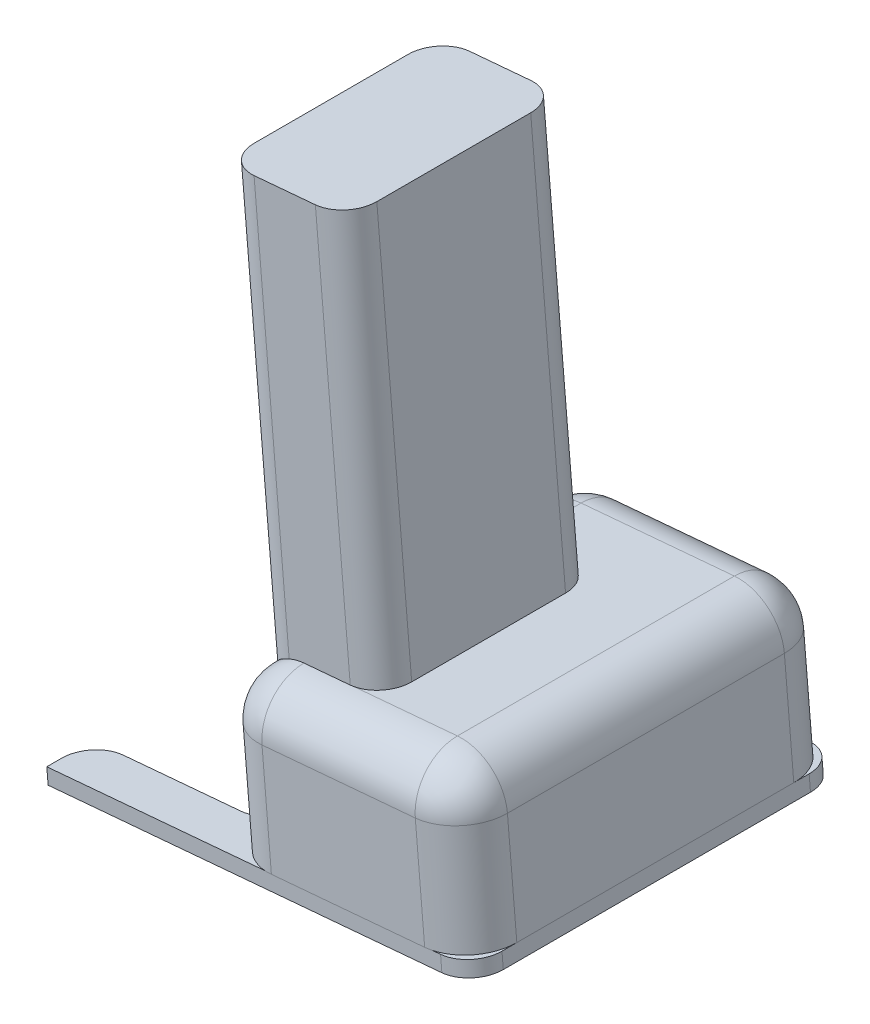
ISO-10303-21;
HEADER;
FILE_DESCRIPTION(('STEP AP214'),'2;1');
FILE_NAME('part.step','',(''),(''),'','','');
FILE_SCHEMA(('AUTOMOTIVE_DESIGN { 1 0 10303 214 1 1 1 1 }'));
ENDSEC;
DATA;
#1=APPLICATION_CONTEXT('core data for automotive mechanical design processes');
#2=APPLICATION_PROTOCOL_DEFINITION('international standard','automotive_design',2000,#1);
#3=PRODUCT_CONTEXT('',#1,'mechanical');
#4=PRODUCT('Part','Part','',(#3));
#5=PRODUCT_RELATED_PRODUCT_CATEGORY('part','',(#4));
#6=PRODUCT_DEFINITION_FORMATION('','',#4);
#7=PRODUCT_DEFINITION_CONTEXT('part definition',#1,'design');
#8=PRODUCT_DEFINITION('design','',#6,#7);
#9=PRODUCT_DEFINITION_SHAPE('','',#8);
#10=(LENGTH_UNIT() NAMED_UNIT(*) SI_UNIT(.MILLI.,.METRE.));
#11=(NAMED_UNIT(*) PLANE_ANGLE_UNIT() SI_UNIT($,.RADIAN.));
#12=(NAMED_UNIT(*) SI_UNIT($,.STERADIAN.) SOLID_ANGLE_UNIT());
#13=UNCERTAINTY_MEASURE_WITH_UNIT(LENGTH_MEASURE(1.E-05),#10,'distance_accuracy_value','');
#14=(GEOMETRIC_REPRESENTATION_CONTEXT(3) GLOBAL_UNCERTAINTY_ASSIGNED_CONTEXT((#13)) GLOBAL_UNIT_ASSIGNED_CONTEXT((#10,
#11,#12)) REPRESENTATION_CONTEXT('',''));
#15=CARTESIAN_POINT('',(0.,0.,0.));
#16=DIRECTION('',(0.,0.,1.));
#17=DIRECTION('',(1.,0.,0.));
#18=AXIS2_PLACEMENT_3D('',#15,#16,#17);
#19=CARTESIAN_POINT('',(-13.7481727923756,-1.70471918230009,11.9823631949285));
#20=DIRECTION('',(0.,0.,1.));
#21=DIRECTION('',(1.,0.,0.));
#22=AXIS2_PLACEMENT_3D('',#19,#20,#21);
#23=PLANE('',#22);
#24=DIRECTION('',(0.996194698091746,0.0871557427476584,0.));
#25=VECTOR('',#24,1.);
#26=CARTESIAN_POINT('',(-13.7917506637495,-1.20662183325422,11.9823631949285));
#27=LINE('',#26,#25);
#28=CARTESIAN_POINT('',(-13.7917506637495,-1.20662183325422,11.9823631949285));
#29=VERTEX_POINT('',#28);
#30=CARTESIAN_POINT('',(-0.996194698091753,-0.087155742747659,11.9823631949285));
#31=VERTEX_POINT('',#30);
#32=EDGE_CURVE('E136',#29,#31,#27,.T.);
#33=ORIENTED_EDGE('',*,*,#32,.F.);
#34=DIRECTION('',(-0.0871557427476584,0.996194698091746,0.));
#35=VECTOR('',#34,1.);
#36=CARTESIAN_POINT('',(-13.7481727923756,-1.70471918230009,11.9823631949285));
#37=LINE('',#36,#35);
#38=CARTESIAN_POINT('',(-13.7481727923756,-1.70471918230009,11.9823631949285));
#39=VERTEX_POINT('',#38);
#40=EDGE_CURVE('E12',#39,#29,#37,.T.);
#41=ORIENTED_EDGE('',*,*,#40,.F.);
#42=DIRECTION('',(0.996194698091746,0.0871557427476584,0.));
#43=VECTOR('',#42,1.);
#44=CARTESIAN_POINT('',(-13.7481727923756,-1.70471918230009,11.9823631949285));
#45=LINE('',#44,#43);
#46=CARTESIAN_POINT('',(-0.952616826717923,-0.585253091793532,11.9823631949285));
#47=VERTEX_POINT('',#46);
#48=EDGE_CURVE('E138',#39,#47,#45,.T.);
#49=ORIENTED_EDGE('',*,*,#48,.T.);
#50=DIRECTION('',(-0.0871557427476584,0.996194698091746,0.));
#51=VECTOR('',#50,1.);
#52=CARTESIAN_POINT('',(-0.952616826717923,-0.585253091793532,11.9823631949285));
#53=LINE('',#52,#51);
#54=EDGE_CURVE('E39',#47,#31,#53,.T.);
#55=ORIENTED_EDGE('',*,*,#54,.T.);
#56=EDGE_LOOP('',(#33,#41,#49,#55));
#57=FACE_BOUND('',#56,.T.);
#58=ADVANCED_FACE('F36',(#57),#23,.T.);
#59=CARTESIAN_POINT('',(-13.7481727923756,-1.70471918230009,11.5));
#60=DIRECTION('',(-0.996194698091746,-0.0871557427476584,0.));
#61=DIRECTION('',(0.0871557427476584,-0.996194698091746,0.));
#62=AXIS2_PLACEMENT_3D('',#59,#60,#61);
#63=PLANE('',#62);
#64=DIRECTION('',(0.,0.,1.));
#65=VECTOR('',#64,1.);
#66=CARTESIAN_POINT('',(-13.7917506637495,-1.20662183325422,11.5));
#67=LINE('',#66,#65);
#68=CARTESIAN_POINT('',(-13.7917506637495,-1.20662183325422,11.5));
#69=VERTEX_POINT('',#68);
#70=EDGE_CURVE('E154',#69,#29,#67,.T.);
#71=ORIENTED_EDGE('',*,*,#70,.F.);
#72=DIRECTION('',(-0.0871557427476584,0.996194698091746,0.));
#73=VECTOR('',#72,1.);
#74=CARTESIAN_POINT('',(-13.7481727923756,-1.70471918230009,11.5));
#75=LINE('',#74,#73);
#76=CARTESIAN_POINT('',(-13.7481727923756,-1.70471918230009,11.5));
#77=VERTEX_POINT('',#76);
#78=EDGE_CURVE('E44',#77,#69,#75,.T.);
#79=ORIENTED_EDGE('',*,*,#78,.F.);
#80=DIRECTION('',(0.,0.,1.));
#81=VECTOR('',#80,1.);
#82=CARTESIAN_POINT('',(-13.7481727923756,-1.70471918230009,11.5));
#83=LINE('',#82,#81);
#84=EDGE_CURVE('E143',#77,#39,#83,.T.);
#85=ORIENTED_EDGE('',*,*,#84,.T.);
#86=ORIENTED_EDGE('',*,*,#40,.T.);
#87=EDGE_LOOP('',(#71,#79,#85,#86));
#88=FACE_BOUND('',#87,.T.);
#89=ADVANCED_FACE('F287',(#88),#63,.T.);
#90=CARTESIAN_POINT('',(-12.7519780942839,-1.61756343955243,11.5));
#91=DIRECTION('',(-0.0871557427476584,0.996194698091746,0.));
#92=DIRECTION('',(-0.996194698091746,-0.0871557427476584,0.));
#93=AXIS2_PLACEMENT_3D('',#90,#91,#92);
#94=CYLINDRICAL_SURFACE('',#93,1.);
#95=CARTESIAN_POINT('',(-12.7955559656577,-1.11946609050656,11.5));
#96=DIRECTION('',(-0.0871557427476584,0.996194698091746,0.));
#97=DIRECTION('',(0.996194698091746,0.0871557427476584,0.));
#98=AXIS2_PLACEMENT_3D('',#95,#96,#97);
#99=CIRCLE('',#98,1.);
#100=CARTESIAN_POINT('',(-12.7955559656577,-1.11946609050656,10.5));
#101=VERTEX_POINT('',#100);
#102=EDGE_CURVE('E185',#101,#69,#99,.T.);
#103=ORIENTED_EDGE('',*,*,#102,.F.);
#104=DIRECTION('',(-0.0871557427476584,0.996194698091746,0.));
#105=VECTOR('',#104,1.);
#106=CARTESIAN_POINT('',(-12.7519780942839,-1.61756343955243,10.5));
#107=LINE('',#106,#105);
#108=CARTESIAN_POINT('',(-12.7519780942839,-1.61756343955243,10.5));
#109=VERTEX_POINT('',#108);
#110=EDGE_CURVE('E225',#109,#101,#107,.T.);
#111=ORIENTED_EDGE('',*,*,#110,.F.);
#112=CARTESIAN_POINT('',(-12.7519780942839,-1.61756343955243,11.5));
#113=DIRECTION('',(-0.0871557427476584,0.996194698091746,0.));
#114=DIRECTION('',(0.996194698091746,0.0871557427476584,0.));
#115=AXIS2_PLACEMENT_3D('',#112,#113,#114);
#116=CIRCLE('',#115,1.);
#117=EDGE_CURVE('E221',#109,#77,#116,.T.);
#118=ORIENTED_EDGE('',*,*,#117,.T.);
#119=ORIENTED_EDGE('',*,*,#78,.T.);
#120=EDGE_LOOP('',(#103,#111,#118,#119));
#121=FACE_BOUND('',#120,.T.);
#122=ADVANCED_FACE('F286',(#121),#94,.T.);
#123=CARTESIAN_POINT('',(-8.9221744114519,-1.2824990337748,10.5));
#124=DIRECTION('',(0.,0.,-1.));
#125=DIRECTION('',(-1.,0.,0.));
#126=AXIS2_PLACEMENT_3D('',#123,#124,#125);
#127=PLANE('',#126);
#128=DIRECTION('',(-0.996194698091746,-0.0871557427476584,0.));
#129=VECTOR('',#128,1.);
#130=CARTESIAN_POINT('',(-8.96575228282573,-0.784401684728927,10.5));
#131=LINE('',#130,#129);
#132=CARTESIAN_POINT('',(-8.96575228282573,-0.784401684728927,10.5));
#133=VERTEX_POINT('',#132);
#134=EDGE_CURVE('E182',#133,#101,#131,.T.);
#135=ORIENTED_EDGE('',*,*,#134,.F.);
#136=DIRECTION('',(-0.0871557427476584,0.996194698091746,0.));
#137=VECTOR('',#136,1.);
#138=CARTESIAN_POINT('',(-8.9221744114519,-1.2824990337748,10.5));
#139=LINE('',#138,#137);
#140=CARTESIAN_POINT('',(-8.9221744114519,-1.2824990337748,10.5));
#141=VERTEX_POINT('',#140);
#142=EDGE_CURVE('E227',#141,#133,#139,.T.);
#143=ORIENTED_EDGE('',*,*,#142,.F.);
#144=DIRECTION('',(-0.996194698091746,-0.0871557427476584,0.));
#145=VECTOR('',#144,1.);
#146=CARTESIAN_POINT('',(-8.9221744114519,-1.2824990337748,10.5));
#147=LINE('',#146,#145);
#148=EDGE_CURVE('E218',#141,#109,#147,.T.);
#149=ORIENTED_EDGE('',*,*,#148,.T.);
#150=ORIENTED_EDGE('',*,*,#110,.T.);
#151=EDGE_LOOP('',(#135,#143,#149,#150));
#152=FACE_BOUND('',#151,.T.);
#153=ADVANCED_FACE('F282',(#152),#127,.T.);
#154=CARTESIAN_POINT('',(-8.92217441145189,-1.2824990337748,9.5));
#155=DIRECTION('',(-0.0871557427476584,0.996194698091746,0.));
#156=DIRECTION('',(-0.996194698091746,-0.0871557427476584,0.));
#157=AXIS2_PLACEMENT_3D('',#154,#155,#156);
#158=CYLINDRICAL_SURFACE('',#157,1.);
#159=CARTESIAN_POINT('',(-8.96575228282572,-0.784401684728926,9.5));
#160=DIRECTION('',(0.0871557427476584,-0.996194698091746,0.));
#161=DIRECTION('',(0.996194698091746,0.0871557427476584,0.));
#162=AXIS2_PLACEMENT_3D('',#159,#160,#161);
#163=CIRCLE('',#162,1.);
#164=CARTESIAN_POINT('',(-7.96955758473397,-0.697245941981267,9.49999999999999));
#165=VERTEX_POINT('',#164);
#166=EDGE_CURVE('E179',#165,#133,#163,.T.);
#167=ORIENTED_EDGE('',*,*,#166,.F.);
#168=DIRECTION('',(-0.0871557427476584,0.996194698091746,0.));
#169=VECTOR('',#168,1.);
#170=CARTESIAN_POINT('',(-7.92597971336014,-1.19534329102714,9.49999999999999));
#171=LINE('',#170,#169);
#172=CARTESIAN_POINT('',(-7.92597971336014,-1.19534329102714,9.49999999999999));
#173=VERTEX_POINT('',#172);
#174=EDGE_CURVE('E229',#173,#165,#171,.T.);
#175=ORIENTED_EDGE('',*,*,#174,.F.);
#176=CARTESIAN_POINT('',(-8.92217441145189,-1.2824990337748,9.5));
#177=DIRECTION('',(0.0871557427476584,-0.996194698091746,0.));
#178=DIRECTION('',(0.996194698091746,0.0871557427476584,0.));
#179=AXIS2_PLACEMENT_3D('',#176,#177,#178);
#180=CIRCLE('',#179,1.);
#181=EDGE_CURVE('E215',#173,#141,#180,.T.);
#182=ORIENTED_EDGE('',*,*,#181,.T.);
#183=ORIENTED_EDGE('',*,*,#142,.T.);
#184=EDGE_LOOP('',(#167,#175,#182,#183));
#185=FACE_BOUND('',#184,.T.);
#186=ADVANCED_FACE('F278',(#185),#158,.F.);
#187=CARTESIAN_POINT('',(-7.92597971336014,-1.19534329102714,9.49999999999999));
#188=DIRECTION('',(-0.996194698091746,-0.0871557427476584,0.));
#189=DIRECTION('',(0.0871557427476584,-0.996194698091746,0.));
#190=AXIS2_PLACEMENT_3D('',#187,#188,#189);
#191=PLANE('',#190);
#192=DIRECTION('',(0.,0.,1.));
#193=VECTOR('',#192,1.);
#194=CARTESIAN_POINT('',(-7.96955758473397,-0.697245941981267,9.49999999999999));
#195=LINE('',#194,#193);
#196=CARTESIAN_POINT('',(-7.96955758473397,-0.697245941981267,2.5));
#197=VERTEX_POINT('',#196);
#198=EDGE_CURVE('E176',#197,#165,#195,.T.);
#199=ORIENTED_EDGE('',*,*,#198,.F.);
#200=DIRECTION('',(-0.0871557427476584,0.996194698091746,0.));
#201=VECTOR('',#200,1.);
#202=CARTESIAN_POINT('',(-7.92597971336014,-1.19534329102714,2.5));
#203=LINE('',#202,#201);
#204=CARTESIAN_POINT('',(-7.92597971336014,-1.19534329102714,2.5));
#205=VERTEX_POINT('',#204);
#206=EDGE_CURVE('E231',#205,#197,#203,.T.);
#207=ORIENTED_EDGE('',*,*,#206,.F.);
#208=DIRECTION('',(0.,0.,1.));
#209=VECTOR('',#208,1.);
#210=CARTESIAN_POINT('',(-7.92597971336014,-1.19534329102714,9.49999999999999));
#211=LINE('',#210,#209);
#212=EDGE_CURVE('E212',#205,#173,#211,.T.);
#213=ORIENTED_EDGE('',*,*,#212,.T.);
#214=ORIENTED_EDGE('',*,*,#174,.T.);
#215=EDGE_LOOP('',(#199,#207,#213,#214));
#216=FACE_BOUND('',#215,.T.);
#217=ADVANCED_FACE('F274',(#216),#191,.T.);
#218=CARTESIAN_POINT('',(-8.92217441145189,-1.2824990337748,2.5));
#219=DIRECTION('',(-0.0871557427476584,0.996194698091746,0.));
#220=DIRECTION('',(-0.996194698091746,-0.0871557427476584,0.));
#221=AXIS2_PLACEMENT_3D('',#218,#219,#220);
#222=CYLINDRICAL_SURFACE('',#221,1.);
#223=CARTESIAN_POINT('',(-8.96575228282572,-0.784401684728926,2.5));
#224=DIRECTION('',(0.0871557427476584,-0.996194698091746,0.));
#225=DIRECTION('',(0.996194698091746,0.0871557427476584,0.));
#226=AXIS2_PLACEMENT_3D('',#223,#224,#225);
#227=CIRCLE('',#226,1.);
#228=CARTESIAN_POINT('',(-8.96575228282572,-0.784401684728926,1.49999999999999));
#229=VERTEX_POINT('',#228);
#230=EDGE_CURVE('E173',#229,#197,#227,.T.);
#231=ORIENTED_EDGE('',*,*,#230,.F.);
#232=DIRECTION('',(-0.0871557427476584,0.996194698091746,0.));
#233=VECTOR('',#232,1.);
#234=CARTESIAN_POINT('',(-8.92217441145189,-1.2824990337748,1.49999999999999));
#235=LINE('',#234,#233);
#236=CARTESIAN_POINT('',(-8.92217441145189,-1.2824990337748,1.49999999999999));
#237=VERTEX_POINT('',#236);
#238=EDGE_CURVE('E233',#237,#229,#235,.T.);
#239=ORIENTED_EDGE('',*,*,#238,.F.);
#240=CARTESIAN_POINT('',(-8.92217441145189,-1.2824990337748,2.5));
#241=DIRECTION('',(0.0871557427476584,-0.996194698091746,0.));
#242=DIRECTION('',(0.996194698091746,0.0871557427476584,0.));
#243=AXIS2_PLACEMENT_3D('',#240,#241,#242);
#244=CIRCLE('',#243,1.);
#245=EDGE_CURVE('E209',#237,#205,#244,.T.);
#246=ORIENTED_EDGE('',*,*,#245,.T.);
#247=ORIENTED_EDGE('',*,*,#206,.T.);
#248=EDGE_LOOP('',(#231,#239,#246,#247));
#249=FACE_BOUND('',#248,.T.);
#250=ADVANCED_FACE('F270',(#249),#222,.F.);
#251=CARTESIAN_POINT('',(-8.92217441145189,-1.2824990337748,1.5));
#252=DIRECTION('',(0.,0.,1.));
#253=DIRECTION('',(1.,0.,0.));
#254=AXIS2_PLACEMENT_3D('',#251,#252,#253);
#255=PLANE('',#254);
#256=DIRECTION('',(0.996194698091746,0.0871557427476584,0.));
#257=VECTOR('',#256,1.);
#258=CARTESIAN_POINT('',(-8.96575228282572,-0.784401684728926,1.5));
#259=LINE('',#258,#257);
#260=CARTESIAN_POINT('',(-12.7955559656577,-1.11946609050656,1.49999999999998));
#261=VERTEX_POINT('',#260);
#262=EDGE_CURVE('E170',#261,#229,#259,.T.);
#263=ORIENTED_EDGE('',*,*,#262,.F.);
#264=DIRECTION('',(-0.0871557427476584,0.996194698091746,0.));
#265=VECTOR('',#264,1.);
#266=CARTESIAN_POINT('',(-12.7519780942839,-1.61756343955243,1.49999999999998));
#267=LINE('',#266,#265);
#268=CARTESIAN_POINT('',(-12.7519780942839,-1.61756343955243,1.49999999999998));
#269=VERTEX_POINT('',#268);
#270=EDGE_CURVE('E235',#269,#261,#267,.T.);
#271=ORIENTED_EDGE('',*,*,#270,.F.);
#272=DIRECTION('',(0.996194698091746,0.0871557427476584,0.));
#273=VECTOR('',#272,1.);
#274=CARTESIAN_POINT('',(-8.92217441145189,-1.2824990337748,1.5));
#275=LINE('',#274,#273);
#276=EDGE_CURVE('E206',#269,#237,#275,.T.);
#277=ORIENTED_EDGE('',*,*,#276,.T.);
#278=ORIENTED_EDGE('',*,*,#238,.T.);
#279=EDGE_LOOP('',(#263,#271,#277,#278));
#280=FACE_BOUND('',#279,.T.);
#281=ADVANCED_FACE('F266',(#280),#255,.T.);
#282=CARTESIAN_POINT('',(-12.7519780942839,-1.61756343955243,0.499999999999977));
#283=DIRECTION('',(-0.0871557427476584,0.996194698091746,0.));
#284=DIRECTION('',(-0.996194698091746,-0.0871557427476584,0.));
#285=AXIS2_PLACEMENT_3D('',#282,#283,#284);
#286=CYLINDRICAL_SURFACE('',#285,1.);
#287=CARTESIAN_POINT('',(-12.7955559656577,-1.11946609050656,0.499999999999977));
#288=DIRECTION('',(-0.0871557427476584,0.996194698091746,0.));
#289=DIRECTION('',(-0.996194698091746,-0.0871557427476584,0.));
#290=AXIS2_PLACEMENT_3D('',#287,#288,#289);
#291=CIRCLE('',#290,1.);
#292=CARTESIAN_POINT('',(-13.7917506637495,-1.20662183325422,0.499999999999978));
#293=VERTEX_POINT('',#292);
#294=EDGE_CURVE('E167',#293,#261,#291,.T.);
#295=ORIENTED_EDGE('',*,*,#294,.F.);
#296=DIRECTION('',(-0.0871557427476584,0.996194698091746,0.));
#297=VECTOR('',#296,1.);
#298=CARTESIAN_POINT('',(-13.7481727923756,-1.70471918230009,0.499999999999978));
#299=LINE('',#298,#297);
#300=CARTESIAN_POINT('',(-13.7481727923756,-1.70471918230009,0.499999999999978));
#301=VERTEX_POINT('',#300);
#302=EDGE_CURVE('E237',#301,#293,#299,.T.);
#303=ORIENTED_EDGE('',*,*,#302,.F.);
#304=CARTESIAN_POINT('',(-12.7519780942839,-1.61756343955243,0.499999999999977));
#305=DIRECTION('',(-0.0871557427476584,0.996194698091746,0.));
#306=DIRECTION('',(-0.996194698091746,-0.0871557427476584,0.));
#307=AXIS2_PLACEMENT_3D('',#304,#305,#306);
#308=CIRCLE('',#307,1.);
#309=EDGE_CURVE('E203',#301,#269,#308,.T.);
#310=ORIENTED_EDGE('',*,*,#309,.T.);
#311=ORIENTED_EDGE('',*,*,#270,.T.);
#312=EDGE_LOOP('',(#295,#303,#310,#311));
#313=FACE_BOUND('',#312,.T.);
#314=ADVANCED_FACE('F262',(#313),#286,.T.);
#315=CARTESIAN_POINT('',(-13.7481727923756,-1.70471918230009,0.499999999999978));
#316=DIRECTION('',(-0.996194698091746,-0.0871557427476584,0.));
#317=DIRECTION('',(0.0871557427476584,-0.996194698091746,0.));
#318=AXIS2_PLACEMENT_3D('',#315,#316,#317);
#319=PLANE('',#318);
#320=DIRECTION('',(0.,0.,1.));
#321=VECTOR('',#320,1.);
#322=CARTESIAN_POINT('',(-13.7917506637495,-1.20662183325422,0.499999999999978));
#323=LINE('',#322,#321);
#324=CARTESIAN_POINT('',(-13.7917506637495,-1.20662183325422,0.));
#325=VERTEX_POINT('',#324);
#326=EDGE_CURVE('E164',#325,#293,#323,.T.);
#327=ORIENTED_EDGE('',*,*,#326,.F.);
#328=DIRECTION('',(-0.0871557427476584,0.996194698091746,0.));
#329=VECTOR('',#328,1.);
#330=CARTESIAN_POINT('',(-13.7481727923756,-1.70471918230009,0.));
#331=LINE('',#330,#329);
#332=CARTESIAN_POINT('',(-13.7481727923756,-1.70471918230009,0.));
#333=VERTEX_POINT('',#332);
#334=EDGE_CURVE('E239',#333,#325,#331,.T.);
#335=ORIENTED_EDGE('',*,*,#334,.F.);
#336=DIRECTION('',(0.,0.,1.));
#337=VECTOR('',#336,1.);
#338=CARTESIAN_POINT('',(-13.7481727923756,-1.70471918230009,0.499999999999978));
#339=LINE('',#338,#337);
#340=EDGE_CURVE('E200',#333,#301,#339,.T.);
#341=ORIENTED_EDGE('',*,*,#340,.T.);
#342=ORIENTED_EDGE('',*,*,#302,.T.);
#343=EDGE_LOOP('',(#327,#335,#341,#342));
#344=FACE_BOUND('',#343,.T.);
#345=ADVANCED_FACE('F258',(#344),#319,.T.);
#346=CARTESIAN_POINT('',(-0.952616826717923,-0.585253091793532,0.));
#347=DIRECTION('',(0.,0.,-1.));
#348=DIRECTION('',(-1.,0.,0.));
#349=AXIS2_PLACEMENT_3D('',#346,#347,#348);
#350=PLANE('',#349);
#351=DIRECTION('',(-0.996194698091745,-0.0871557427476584,0.));
#352=VECTOR('',#351,1.);
#353=CARTESIAN_POINT('',(-0.996194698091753,-0.087155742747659,0.));
#354=LINE('',#353,#352);
#355=CARTESIAN_POINT('',(-0.996194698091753,-0.087155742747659,0.));
#356=VERTEX_POINT('',#355);
#357=EDGE_CURVE('E161',#356,#325,#354,.T.);
#358=ORIENTED_EDGE('',*,*,#357,.F.);
#359=DIRECTION('',(-0.0871557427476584,0.996194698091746,0.));
#360=VECTOR('',#359,1.);
#361=CARTESIAN_POINT('',(-0.952616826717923,-0.585253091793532,0.));
#362=LINE('',#361,#360);
#363=CARTESIAN_POINT('',(-0.952616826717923,-0.585253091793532,0.));
#364=VERTEX_POINT('',#363);
#365=EDGE_CURVE('E241',#364,#356,#362,.T.);
#366=ORIENTED_EDGE('',*,*,#365,.F.);
#367=DIRECTION('',(-0.996194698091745,-0.0871557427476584,0.));
#368=VECTOR('',#367,1.);
#369=CARTESIAN_POINT('',(-0.952616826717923,-0.585253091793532,0.));
#370=LINE('',#369,#368);
#371=EDGE_CURVE('E197',#364,#333,#370,.T.);
#372=ORIENTED_EDGE('',*,*,#371,.T.);
#373=ORIENTED_EDGE('',*,*,#334,.T.);
#374=EDGE_LOOP('',(#358,#366,#372,#373));
#375=FACE_BOUND('',#374,.T.);
#376=ADVANCED_FACE('F254',(#375),#350,.T.);
#377=CARTESIAN_POINT('',(-0.952616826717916,-0.585253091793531,1.));
#378=DIRECTION('',(-0.0871557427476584,0.996194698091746,0.));
#379=DIRECTION('',(-0.996194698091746,-0.0871557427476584,0.));
#380=AXIS2_PLACEMENT_3D('',#377,#378,#379);
#381=CYLINDRICAL_SURFACE('',#380,1.);
#382=CARTESIAN_POINT('',(-0.996194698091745,-0.0871557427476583,1.));
#383=DIRECTION('',(-0.0871557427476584,0.996194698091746,0.));
#384=DIRECTION('',(0.996194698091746,0.0871557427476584,0.));
#385=AXIS2_PLACEMENT_3D('',#382,#383,#384);
#386=CIRCLE('',#385,1.);
#387=CARTESIAN_POINT('',(0.,0.,1.00000000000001));
#388=VERTEX_POINT('',#387);
#389=EDGE_CURVE('E158',#388,#356,#386,.T.);
#390=ORIENTED_EDGE('',*,*,#389,.F.);
#391=DIRECTION('',(-0.0871557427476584,0.996194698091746,0.));
#392=VECTOR('',#391,1.);
#393=CARTESIAN_POINT('',(0.0435778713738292,-0.498097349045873,1.00000000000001));
#394=LINE('',#393,#392);
#395=CARTESIAN_POINT('',(0.0435778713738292,-0.498097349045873,1.00000000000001));
#396=VERTEX_POINT('',#395);
#397=EDGE_CURVE('E243',#396,#388,#394,.T.);
#398=ORIENTED_EDGE('',*,*,#397,.F.);
#399=CARTESIAN_POINT('',(-0.952616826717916,-0.585253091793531,1.));
#400=DIRECTION('',(-0.0871557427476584,0.996194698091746,0.));
#401=DIRECTION('',(0.996194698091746,0.0871557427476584,0.));
#402=AXIS2_PLACEMENT_3D('',#399,#400,#401);
#403=CIRCLE('',#402,1.);
#404=EDGE_CURVE('E194',#396,#364,#403,.T.);
#405=ORIENTED_EDGE('',*,*,#404,.T.);
#406=ORIENTED_EDGE('',*,*,#365,.T.);
#407=EDGE_LOOP('',(#390,#398,#405,#406));
#408=FACE_BOUND('',#407,.T.);
#409=ADVANCED_FACE('F250',(#408),#381,.T.);
#410=CARTESIAN_POINT('',(0.0435778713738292,-0.498097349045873,10.9823631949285));
#411=DIRECTION('',(0.996194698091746,0.0871557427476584,0.));
#412=DIRECTION('',(-0.0871557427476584,0.996194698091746,0.));
#413=AXIS2_PLACEMENT_3D('',#410,#411,#412);
#414=PLANE('',#413);
#415=DIRECTION('',(0.,0.,-1.));
#416=VECTOR('',#415,1.);
#417=CARTESIAN_POINT('',(0.,0.,10.9823631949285));
#418=LINE('',#417,#416);
#419=CARTESIAN_POINT('',(0.,0.,10.9823631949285));
#420=VERTEX_POINT('',#419);
#421=EDGE_CURVE('E150',#420,#388,#418,.T.);
#422=ORIENTED_EDGE('',*,*,#421,.F.);
#423=DIRECTION('',(-0.0871557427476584,0.996194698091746,0.));
#424=VECTOR('',#423,1.);
#425=CARTESIAN_POINT('',(0.0435778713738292,-0.498097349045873,10.9823631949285));
#426=LINE('',#425,#424);
#427=CARTESIAN_POINT('',(0.0435778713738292,-0.498097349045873,10.9823631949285));
#428=VERTEX_POINT('',#427);
#429=EDGE_CURVE('E142',#428,#420,#426,.T.);
#430=ORIENTED_EDGE('',*,*,#429,.F.);
#431=DIRECTION('',(0.,0.,-1.));
#432=VECTOR('',#431,1.);
#433=CARTESIAN_POINT('',(0.0435778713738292,-0.498097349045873,10.9823631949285));
#434=LINE('',#433,#432);
#435=EDGE_CURVE('E191',#428,#396,#434,.T.);
#436=ORIENTED_EDGE('',*,*,#435,.T.);
#437=ORIENTED_EDGE('',*,*,#397,.T.);
#438=EDGE_LOOP('',(#422,#430,#436,#437));
#439=FACE_BOUND('',#438,.T.);
#440=ADVANCED_FACE('F246',(#439),#414,.T.);
#441=CARTESIAN_POINT('',(-0.952616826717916,-0.585253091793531,10.9823631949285));
#442=DIRECTION('',(-0.0871557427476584,0.996194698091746,0.));
#443=DIRECTION('',(-0.996194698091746,-0.0871557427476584,0.));
#444=AXIS2_PLACEMENT_3D('',#441,#442,#443);
#445=CYLINDRICAL_SURFACE('',#444,1.);
#446=CARTESIAN_POINT('',(-0.996194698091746,-0.0871557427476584,10.9823631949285));
#447=DIRECTION('',(-0.0871557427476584,0.996194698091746,0.));
#448=DIRECTION('',(0.996194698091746,0.0871557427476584,0.));
#449=AXIS2_PLACEMENT_3D('',#446,#447,#448);
#450=CIRCLE('',#449,1.);
#451=EDGE_CURVE('E145',#31,#420,#450,.T.);
#452=ORIENTED_EDGE('',*,*,#451,.F.);
#453=ORIENTED_EDGE('',*,*,#54,.F.);
#454=CARTESIAN_POINT('',(-0.952616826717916,-0.585253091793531,10.9823631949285));
#455=DIRECTION('',(-0.0871557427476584,0.996194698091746,0.));
#456=DIRECTION('',(0.996194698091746,0.0871557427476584,0.));
#457=AXIS2_PLACEMENT_3D('',#454,#455,#456);
#458=CIRCLE('',#457,1.);
#459=EDGE_CURVE('E189',#47,#428,#458,.T.);
#460=ORIENTED_EDGE('',*,*,#459,.T.);
#461=ORIENTED_EDGE('',*,*,#429,.T.);
#462=EDGE_LOOP('',(#452,#453,#460,#461));
#463=FACE_BOUND('',#462,.T.);
#464=ADVANCED_FACE('F146',(#463),#445,.T.);
#465=CARTESIAN_POINT('',(-0.952616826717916,-0.585253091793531,10.9823631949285));
#466=DIRECTION('',(0.0871557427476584,-0.996194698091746,0.));
#467=DIRECTION('',(0.996194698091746,0.0871557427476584,0.));
#468=AXIS2_PLACEMENT_3D('',#465,#466,#467);
#469=PLANE('',#468);
#470=ORIENTED_EDGE('',*,*,#48,.F.);
#471=ORIENTED_EDGE('',*,*,#84,.F.);
#472=ORIENTED_EDGE('',*,*,#117,.F.);
#473=ORIENTED_EDGE('',*,*,#148,.F.);
#474=ORIENTED_EDGE('',*,*,#181,.F.);
#475=ORIENTED_EDGE('',*,*,#212,.F.);
#476=ORIENTED_EDGE('',*,*,#245,.F.);
#477=ORIENTED_EDGE('',*,*,#276,.F.);
#478=ORIENTED_EDGE('',*,*,#309,.F.);
#479=ORIENTED_EDGE('',*,*,#340,.F.);
#480=ORIENTED_EDGE('',*,*,#371,.F.);
#481=ORIENTED_EDGE('',*,*,#404,.F.);
#482=ORIENTED_EDGE('',*,*,#435,.F.);
#483=ORIENTED_EDGE('',*,*,#459,.F.);
#484=EDGE_LOOP('',(#470,#471,#472,#473,#474,#475,#476,#477,#478,#479,#480,#481,#482,#483));
#485=FACE_BOUND('',#484,.T.);
#486=ADVANCED_FACE('F290',(#485),#469,.T.);
#487=CARTESIAN_POINT('',(-0.996194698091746,-0.0871557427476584,10.9823631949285));
#488=DIRECTION('',(0.0871557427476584,-0.996194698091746,0.));
#489=DIRECTION('',(0.996194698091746,0.0871557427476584,0.));
#490=AXIS2_PLACEMENT_3D('',#487,#488,#489);
#491=PLANE('',#490);
#492=ORIENTED_EDGE('',*,*,#32,.T.);
#493=ORIENTED_EDGE('',*,*,#451,.T.);
#494=ORIENTED_EDGE('',*,*,#421,.T.);
#495=ORIENTED_EDGE('',*,*,#389,.T.);
#496=ORIENTED_EDGE('',*,*,#357,.T.);
#497=ORIENTED_EDGE('',*,*,#326,.T.);
#498=ORIENTED_EDGE('',*,*,#294,.T.);
#499=ORIENTED_EDGE('',*,*,#262,.T.);
#500=ORIENTED_EDGE('',*,*,#230,.T.);
#501=ORIENTED_EDGE('',*,*,#198,.T.);
#502=ORIENTED_EDGE('',*,*,#166,.T.);
#503=ORIENTED_EDGE('',*,*,#134,.T.);
#504=ORIENTED_EDGE('',*,*,#102,.T.);
#505=ORIENTED_EDGE('',*,*,#70,.T.);
#506=EDGE_LOOP('',(#492,#493,#494,#495,#496,#497,#498,#499,#500,#501,#502,#503,#504,#505));
#507=FACE_BOUND('',#506,.T.);
#508=ADVANCED_FACE('F152',(#507),#491,.F.);
#509=CLOSED_SHELL('',(#58,#89,#122,#153,#186,#217,#250,#281,#314,#345,#376,#409,#440,#464,#486,#508));
#510=MANIFOLD_SOLID_BREP('B2',#509);
#511=CARTESIAN_POINT('',(-0.435778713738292,4.98097349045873,12.));
#512=DIRECTION('',(0.0871557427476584,-0.996194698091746,0.));
#513=DIRECTION('',(0.996194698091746,0.0871557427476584,0.));
#514=AXIS2_PLACEMENT_3D('',#511,#512,#513);
#515=PLANE('',#514);
#516=CARTESIAN_POINT('',(-5.40655084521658,4.54608727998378,9.50617415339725));
#517=DIRECTION('',(0.0871557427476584,-0.996194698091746,0.));
#518=DIRECTION('',(0.996194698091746,0.0871557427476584,0.));
#519=AXIS2_PLACEMENT_3D('',#516,#517,#518);
#520=CIRCLE('',#519,1.);
#521=CARTESIAN_POINT('',(-5.29602176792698,4.5557573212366,10.5));
#522=VERTEX_POINT('',#521);
#523=CARTESIAN_POINT('',(-4.41035614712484,4.63324302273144,9.50617415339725));
#524=VERTEX_POINT('',#523);
#525=EDGE_CURVE('E551',#522,#524,#520,.F.);
#526=ORIENTED_EDGE('',*,*,#525,.F.);
#527=DIRECTION('',(0.996194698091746,0.0871557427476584,0.));
#528=VECTOR('',#527,1.);
#529=CARTESIAN_POINT('',(-0.435778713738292,4.98097349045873,10.5));
#530=LINE('',#529,#528);
#531=CARTESIAN_POINT('',(-1.93007076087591,4.85023987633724,10.5));
#532=VERTEX_POINT('',#531);
#533=EDGE_CURVE('E415',#522,#532,#530,.T.);
#534=ORIENTED_EDGE('',*,*,#533,.T.);
#535=DIRECTION('',(0.,0.,-1.));
#536=VECTOR('',#535,1.);
#537=CARTESIAN_POINT('',(-1.93007076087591,4.85023987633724,12.));
#538=LINE('',#537,#536);
#539=CARTESIAN_POINT('',(-1.93007076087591,4.85023987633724,1.5));
#540=VERTEX_POINT('',#539);
#541=EDGE_CURVE('E591',#532,#540,#538,.T.);
#542=ORIENTED_EDGE('',*,*,#541,.T.);
#543=DIRECTION('',(-0.996194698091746,-0.0871557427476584,0.));
#544=VECTOR('',#543,1.);
#545=CARTESIAN_POINT('',(-0.435778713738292,4.98097349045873,1.5));
#546=LINE('',#545,#544);
#547=CARTESIAN_POINT('',(-6.91104425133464,4.41446116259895,1.5));
#548=VERTEX_POINT('',#547);
#549=EDGE_CURVE('E694',#540,#548,#546,.T.);
#550=ORIENTED_EDGE('',*,*,#549,.T.);
#551=DIRECTION('',(0.,0.,1.));
#552=VECTOR('',#551,1.);
#553=CARTESIAN_POINT('',(-6.91104425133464,4.41446116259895,12.));
#554=LINE('',#553,#552);
#555=CARTESIAN_POINT('',(-6.91104425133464,4.41446116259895,3.50617415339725));
#556=VERTEX_POINT('',#555);
#557=EDGE_CURVE('E696',#548,#556,#554,.T.);
#558=ORIENTED_EDGE('',*,*,#557,.T.);
#559=DIRECTION('',(-0.996194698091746,-0.0871557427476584,0.));
#560=VECTOR('',#559,1.);
#561=CARTESIAN_POINT('',(-0.435778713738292,4.98097349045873,3.50617415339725));
#562=LINE('',#561,#560);
#563=CARTESIAN_POINT('',(-5.40655084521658,4.54608727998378,3.50617415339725));
#564=VERTEX_POINT('',#563);
#565=EDGE_CURVE('E555',#564,#556,#562,.T.);
#566=ORIENTED_EDGE('',*,*,#565,.F.);
#567=CARTESIAN_POINT('',(-5.40655084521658,4.54608727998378,4.50617415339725));
#568=DIRECTION('',(0.0871557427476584,-0.996194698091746,0.));
#569=DIRECTION('',(0.996194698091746,0.0871557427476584,0.));
#570=AXIS2_PLACEMENT_3D('',#567,#568,#569);
#571=CIRCLE('',#570,0.999999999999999);
#572=CARTESIAN_POINT('',(-4.41035614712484,4.63324302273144,4.50617415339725));
#573=VERTEX_POINT('',#572);
#574=EDGE_CURVE('E770',#573,#564,#571,.F.);
#575=ORIENTED_EDGE('',*,*,#574,.F.);
#576=DIRECTION('',(0.,0.,-1.));
#577=VECTOR('',#576,1.);
#578=CARTESIAN_POINT('',(-4.41035614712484,4.63324302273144,12.));
#579=LINE('',#578,#577);
#580=EDGE_CURVE('E768',#524,#573,#579,.T.);
#581=ORIENTED_EDGE('',*,*,#580,.F.);
#582=EDGE_LOOP('',(#526,#534,#542,#550,#558,#566,#575,#581));
#583=FACE_BOUND('',#582,.T.);
#584=ADVANCED_FACE('F388',(#583),#515,.F.);
#585=CARTESIAN_POINT('',(-0.305045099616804,3.48668144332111,10.5));
#586=DIRECTION('',(0.996194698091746,0.0871557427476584,0.));
#587=DIRECTION('',(-0.0871557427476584,0.996194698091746,0.));
#588=AXIS2_PLACEMENT_3D('',#585,#586,#587);
#589=CYLINDRICAL_SURFACE('',#588,1.5);
#590=ORIENTED_EDGE('',*,*,#533,.F.);
#591=CARTESIAN_POINT('',(-5.51707992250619,4.53641723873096,10.5));
#592=CARTESIAN_POINT('',(-5.57210229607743,4.53160606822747,10.4938312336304));
#593=CARTESIAN_POINT('',(-5.62666193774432,4.52681315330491,10.4830409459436));
#594=CARTESIAN_POINT('',(-5.73324780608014,4.51682654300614,10.4524937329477));
#595=CARTESIAN_POINT('',(-5.78526952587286,4.51163217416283,10.4327214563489));
#596=CARTESIAN_POINT('',(-5.88518399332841,4.49995491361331,10.3847540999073));
#597=CARTESIAN_POINT('',(-5.93307369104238,4.49347108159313,10.3565528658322));
#598=CARTESIAN_POINT('',(-6.02308495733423,4.47803967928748,10.2926474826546));
#599=CARTESIAN_POINT('',(-6.06521040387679,4.46909377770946,10.2569484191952));
#600=CARTESIAN_POINT('',(-6.14105066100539,4.44779661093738,10.1806069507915));
#601=CARTESIAN_POINT('',(-6.17498613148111,4.43555979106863,10.1401526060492));
#602=CARTESIAN_POINT('',(-6.23498107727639,4.40657347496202,10.0552345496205));
#603=CARTESIAN_POINT('',(-6.2610453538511,4.38982674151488,10.0107733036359));
#604=CARTESIAN_POINT('',(-6.30326632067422,4.35257596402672,9.92313771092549));
#605=CARTESIAN_POINT('',(-6.31998354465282,4.33241187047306,9.88008701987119));
#606=CARTESIAN_POINT('',(-6.34631777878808,4.28761441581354,9.79415701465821));
#607=CARTESIAN_POINT('',(-6.35593400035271,4.26298055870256,9.75127772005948));
#608=CARTESIAN_POINT('',(-6.36887028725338,4.20905302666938,9.66649523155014));
#609=CARTESIAN_POINT('',(-6.37207570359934,4.17968447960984,9.62462282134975));
#610=CARTESIAN_POINT('',(-6.3729530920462,4.11709335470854,9.54382498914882));
#611=CARTESIAN_POINT('',(-6.37062163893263,4.08386840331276,9.50490140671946));
#612=CARTESIAN_POINT('',(-6.35951120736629,3.9973426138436,9.41299660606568));
#613=CARTESIAN_POINT('',(-6.34818080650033,3.94204299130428,9.36220136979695));
#614=CARTESIAN_POINT('',(-6.3200350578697,3.82538846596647,9.26986637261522));
#615=CARTESIAN_POINT('',(-6.30320727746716,3.76402005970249,9.22834795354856));
#616=CARTESIAN_POINT('',(-6.2673026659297,3.63478370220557,9.15437494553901));
#617=CARTESIAN_POINT('',(-6.24818477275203,3.56680314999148,9.12213789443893));
#618=CARTESIAN_POINT('',(-6.21164029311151,3.42626381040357,9.06851146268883));
#619=CARTESIAN_POINT('',(-6.19421209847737,3.35370948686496,9.04711168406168));
#620=CARTESIAN_POINT('',(-6.17098671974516,3.23860470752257,9.0228277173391));
#621=CARTESIAN_POINT('',(-6.16348104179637,3.19721206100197,9.01594429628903));
#622=CARTESIAN_POINT('',(-6.15034101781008,3.11370310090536,9.00574859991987));
#623=CARTESIAN_POINT('',(-6.14470581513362,3.07158712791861,9.00243468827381));
#624=CARTESIAN_POINT('',(-6.13554278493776,2.98701370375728,8.99943291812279));
#625=CARTESIAN_POINT('',(-6.13201410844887,2.94455639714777,8.99974359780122));
#626=CARTESIAN_POINT('',(-6.12707106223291,2.85971175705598,9.00397723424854));
#627=CARTESIAN_POINT('',(-6.12565656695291,2.81732441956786,9.00789997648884));
#628=CARTESIAN_POINT('',(-6.12443681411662,2.70184877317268,9.02351851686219));
#629=CARTESIAN_POINT('',(-6.12659069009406,2.62919880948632,9.03881493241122));
#630=CARTESIAN_POINT('',(-6.13460600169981,2.48700902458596,9.0796234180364));
#631=CARTESIAN_POINT('',(-6.14047339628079,2.41747439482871,9.10515188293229));
#632=CARTESIAN_POINT('',(-6.1536806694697,2.27587382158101,9.16903903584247));
#633=CARTESIAN_POINT('',(-6.16111007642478,2.20428980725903,9.20845157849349));
#634=CARTESIAN_POINT('',(-6.17280726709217,2.06828685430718,9.29847665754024));
#635=CARTESIAN_POINT('',(-6.17708001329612,2.00385680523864,9.34907145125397));
#636=CARTESIAN_POINT('',(-6.17789367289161,1.90006674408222,9.44575442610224));
#637=CARTESIAN_POINT('',(-6.1761729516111,1.85857057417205,9.48952650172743));
#638=CARTESIAN_POINT('',(-6.16672629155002,1.78177493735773,9.58165696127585));
#639=CARTESIAN_POINT('',(-6.15900555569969,1.7464701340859,9.63001133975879));
#640=CARTESIAN_POINT('',(-6.13571184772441,1.68287377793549,9.73014115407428));
#641=CARTESIAN_POINT('',(-6.12006325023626,1.65465376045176,9.7819452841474));
#642=CARTESIAN_POINT('',(-6.07965260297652,1.60649802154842,9.88585742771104));
#643=CARTESIAN_POINT('',(-6.05489903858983,1.58655462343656,9.93796511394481));
#644=CARTESIAN_POINT('',(-6.00045635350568,1.55715044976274,10.0317966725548));
#645=CARTESIAN_POINT('',(-5.9720376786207,1.54657591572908,10.073916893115));
#646=CARTESIAN_POINT('',(-5.90890619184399,1.530630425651,10.1542437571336));
#647=CARTESIAN_POINT('',(-5.87419282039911,1.52525993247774,10.1924500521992));
#648=CARTESIAN_POINT('',(-5.80037484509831,1.51875972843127,10.2624281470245));
#649=CARTESIAN_POINT('',(-5.76142449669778,1.5175129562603,10.294352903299));
#650=CARTESIAN_POINT('',(-5.67926757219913,1.51781777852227,10.3521255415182));
#651=CARTESIAN_POINT('',(-5.63606015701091,1.51936992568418,10.3779722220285));
#652=CARTESIAN_POINT('',(-5.54327420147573,1.52438215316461,10.4244483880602));
#653=CARTESIAN_POINT('',(-5.49346194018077,1.52796579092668,10.4445984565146));
#654=CARTESIAN_POINT('',(-5.39131606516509,1.53605705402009,10.4766342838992));
#655=CARTESIAN_POINT('',(-5.338981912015,1.5405648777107,10.4885182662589));
#656=CARTESIAN_POINT('',(-5.23084517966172,1.54998366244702,10.5040313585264));
#657=CARTESIAN_POINT('',(-5.17498965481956,1.55490361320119,10.5072887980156));
#658=CARTESIAN_POINT('',(-5.06351274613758,1.56464565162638,10.5043869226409));
#659=CARTESIAN_POINT('',(-5.00789138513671,1.5694677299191,10.4982267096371));
#660=CARTESIAN_POINT('',(-4.89822347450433,1.57924479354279,10.476611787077));
#661=CARTESIAN_POINT('',(-4.84418545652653,1.58420029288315,10.4611139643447));
#662=CARTESIAN_POINT('',(-4.73956765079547,1.59492628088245,10.4212271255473));
#663=CARTESIAN_POINT('',(-4.68898830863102,1.60069687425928,10.3968369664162));
#664=CARTESIAN_POINT('',(-4.59320209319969,1.61409733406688,10.3400863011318));
#665=CARTESIAN_POINT('',(-4.5479639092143,1.62171547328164,10.3077760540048));
#666=CARTESIAN_POINT('',(-4.46406995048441,1.64010072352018,10.2362500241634));
#667=CARTESIAN_POINT('',(-4.42541015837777,1.65086590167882,10.1970384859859));
#668=CARTESIAN_POINT('',(-4.35784619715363,1.67609519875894,10.1155686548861));
#669=CARTESIAN_POINT('',(-4.32853701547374,1.69033596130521,10.0735776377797));
#670=CARTESIAN_POINT('',(-4.27783858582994,1.72351169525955,9.98678122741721));
#671=CARTESIAN_POINT('',(-4.25644557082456,1.74244442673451,9.94197718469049));
#672=CARTESIAN_POINT('',(-4.22274818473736,1.78402542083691,9.85434530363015));
#673=CARTESIAN_POINT('',(-4.20998064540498,1.80638728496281,9.81155754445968));
#674=CARTESIAN_POINT('',(-4.19111527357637,1.85538872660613,9.72699147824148));
#675=CARTESIAN_POINT('',(-4.18501908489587,1.88202935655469,9.6852134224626));
#676=CARTESIAN_POINT('',(-4.17844020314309,1.94082089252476,9.60167381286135));
#677=CARTESIAN_POINT('',(-4.17829476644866,1.97319833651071,9.56004703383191));
#678=CARTESIAN_POINT('',(-4.18316477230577,2.04174128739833,9.48039116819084));
#679=CARTESIAN_POINT('',(-4.1881837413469,2.07790936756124,9.44236455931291));
#680=CARTESIAN_POINT('',(-4.20561613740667,2.17311917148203,9.35189615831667));
#681=CARTESIAN_POINT('',(-4.22051259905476,2.23430856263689,9.30218410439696));
#682=CARTESIAN_POINT('',(-4.25461540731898,2.36297554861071,9.21338905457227));
#683=CARTESIAN_POINT('',(-4.27383237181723,2.4304683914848,9.17433277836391));
#684=CARTESIAN_POINT('',(-4.3128071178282,2.57210878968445,9.1068504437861));
#685=CARTESIAN_POINT('',(-4.33256826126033,2.64635789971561,9.078638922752));
#686=CARTESIAN_POINT('',(-4.36813508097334,2.79930495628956,9.03467949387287));
#687=CARTESIAN_POINT('',(-4.38394917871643,2.87799298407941,9.0189048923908));
#688=CARTESIAN_POINT('',(-4.40244281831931,2.99820158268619,9.00503798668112));
#689=CARTESIAN_POINT('',(-4.40774700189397,3.03880547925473,9.0020564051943));
#690=CARTESIAN_POINT('',(-4.41640686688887,3.12033816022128,8.9994550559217));
#691=CARTESIAN_POINT('',(-4.41976255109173,3.16126694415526,8.99983528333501));
#692=CARTESIAN_POINT('',(-4.42450412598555,3.24307337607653,9.00395714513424));
#693=CARTESIAN_POINT('',(-4.42588969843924,3.28395101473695,9.0076993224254));
#694=CARTESIAN_POINT('',(-4.42687043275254,3.36529577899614,9.01848675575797));
#695=CARTESIAN_POINT('',(-4.42646482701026,3.40576272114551,9.02553342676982));
#696=CARTESIAN_POINT('',(-4.42325323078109,3.51808419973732,9.04978490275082));
#697=CARTESIAN_POINT('',(-4.41878588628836,3.58913788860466,9.07060594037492));
#698=CARTESIAN_POINT('',(-4.40764922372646,3.72742277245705,9.12214453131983));
#699=CARTESIAN_POINT('',(-4.40097655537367,3.79464796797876,9.1528771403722));
#700=CARTESIAN_POINT('',(-4.38750583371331,3.93358722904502,9.22901372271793));
#701=CARTESIAN_POINT('',(-4.38083395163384,4.00450505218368,9.27591155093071));
#702=CARTESIAN_POINT('',(-4.37338758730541,4.13740890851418,9.38134362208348));
#703=CARTESIAN_POINT('',(-4.37259703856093,4.19941882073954,9.43984571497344));
#704=CARTESIAN_POINT('',(-4.38042943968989,4.29256785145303,9.54493794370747));
#705=CARTESIAN_POINT('',(-4.38594212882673,4.32703334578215,9.58881197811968));
#706=CARTESIAN_POINT('',(-4.4032122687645,4.38991581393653,9.67958146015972));
#707=CARTESIAN_POINT('',(-4.41496380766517,4.41833847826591,9.72647401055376));
#708=CARTESIAN_POINT('',(-4.44596416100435,4.46856202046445,9.82181512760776));
#709=CARTESIAN_POINT('',(-4.4652642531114,4.4903157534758,9.87027221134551));
#710=CARTESIAN_POINT('',(-4.51189723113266,4.52667869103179,9.96600127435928));
#711=CARTESIAN_POINT('',(-4.53922802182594,4.54128975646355,10.0132735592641));
#712=CARTESIAN_POINT('',(-4.59834803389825,4.56271163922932,10.0993150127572));
#713=CARTESIAN_POINT('',(-4.62936544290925,4.57018148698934,10.1384555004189));
#714=CARTESIAN_POINT('',(-4.69698315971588,4.58068698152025,10.2122413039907));
#715=CARTESIAN_POINT('',(-4.73358389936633,4.58372228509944,10.2468862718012));
#716=CARTESIAN_POINT('',(-4.81199417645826,4.58644974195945,10.3108987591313));
#717=CARTESIAN_POINT('',(-4.85386259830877,4.58610003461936,10.340195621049));
#718=CARTESIAN_POINT('',(-4.94147952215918,4.58310716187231,10.392145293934));
#719=CARTESIAN_POINT('',(-4.98723030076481,4.58046264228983,10.4147941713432));
#720=CARTESIAN_POINT('',(-5.08489221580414,4.5736668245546,10.4541996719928));
#721=CARTESIAN_POINT('',(-5.1370102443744,4.56942236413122,10.4704276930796));
#722=CARTESIAN_POINT('',(-5.2431027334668,4.56042357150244,10.4941249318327));
#723=CARTESIAN_POINT('',(-5.29707452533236,4.55566995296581,10.50160623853));
#724=CARTESIAN_POINT('',(-5.37889355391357,4.54849371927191,10.5061762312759));
#725=CARTESIAN_POINT('',(-5.40659242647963,4.54606945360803,10.5065599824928));
#726=CARTESIAN_POINT('',(-5.46192608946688,4.54123434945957,10.5050144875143));
#727=CARTESIAN_POINT('',(-5.48956088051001,4.53882351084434,10.5030852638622));
#728=CARTESIAN_POINT('',(-5.51707992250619,4.53641723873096,10.5));
#729=B_SPLINE_CURVE_WITH_KNOTS('',3,(#591,#592,#593,#594,#595,#596,#597,#598,#599,#600,#601,
#602,#603,#604,#605,#606,#607,#608,#609,#610,#611,#612,#613,#614,#615,#616,#617,#618,#619,#620,
#621,#622,#623,#624,#625,#626,#627,#628,#629,#630,#631,#632,#633,#634,#635,#636,#637,#638,#639,
#640,#641,#642,#643,#644,#645,#646,#647,#648,#649,#650,#651,#652,#653,#654,#655,#656,#657,#658,
#659,#660,#661,#662,#663,#664,#665,#666,#667,#668,#669,#670,#671,#672,#673,#674,#675,#676,#677,
#678,#679,#680,#681,#682,#683,#684,#685,#686,#687,#688,#689,#690,#691,#692,#693,#694,#695,#696,
#697,#698,#699,#700,#701,#702,#703,#704,#705,#706,#707,#708,#709,#710,#711,#712,#713,#714,#715,
#716,#717,#718,#719,#720,#721,#722,#723,#724,#725,#726,#727,#728),.UNSPECIFIED.,.T.,.F.,(4,2,2,
2,2,2,2,2,2,2,2,2,2,2,2,2,2,2,2,2,2,2,2,2,2,2,2,2,2,2,2,2,2,2,2,2,2,2,2,2,2,2,2,2,2,2,2,2,2,2,2,
2,2,2,2,2,2,2,2,2,2,2,2,2,2,2,2,2,4),(0.,0.166626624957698,0.333539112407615,0.500573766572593,
0.667495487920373,0.829230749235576,0.990867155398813,1.14132496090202,1.29179947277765,
1.44494179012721,1.59817886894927,1.82474338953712,2.05182388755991,2.2838592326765,
2.51567152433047,2.64338346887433,2.77103684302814,2.89863873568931,3.02623305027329,
3.24803060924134,3.47018498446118,3.71531449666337,3.96005782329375,4.14041424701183,
4.320614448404,4.50256692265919,4.68435025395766,4.83926255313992,4.99418862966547,
5.14467721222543,5.29519551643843,5.45603738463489,5.6169138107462,5.78461659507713,
5.95233537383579,6.1208345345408,6.28935536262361,6.45683329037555,6.62420857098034,
6.78281431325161,6.94134448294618,7.09048736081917,7.23966697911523,7.39729023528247,
7.55502119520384,7.79441479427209,8.03440327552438,8.27892109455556,8.52291265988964,
8.64592488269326,8.76893692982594,8.89196884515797,9.01505349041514,9.2366504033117,
9.45858552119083,9.71319498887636,9.96710866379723,10.1346614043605,10.3020556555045,
10.470607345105,10.6391150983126,10.7898906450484,10.9406778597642,11.0933321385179,
11.2460765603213,11.4096000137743,11.5728971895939,11.6562351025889,11.7395722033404),.UNSPECIFIED.);
#730=CARTESIAN_POINT('',(-5.40654973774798,4.54607462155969,10.5061741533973));
#731=VERTEX_POINT('',#730);
#732=EDGE_CURVE('E34',#522,#731,#729,.T.);
#733=ORIENTED_EDGE('',*,*,#732,.T.);
#734=DIRECTION('',(0.996194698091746,0.0871557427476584,0.));
#735=VECTOR('',#734,1.);
#736=CARTESIAN_POINT('',(-0.435777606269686,4.98096083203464,10.5061741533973));
#737=LINE('',#736,#735);
#738=CARTESIAN_POINT('',(-6.91104314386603,4.41444850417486,10.5061741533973));
#739=VERTEX_POINT('',#738);
#740=EDGE_CURVE('E772',#731,#739,#737,.F.);
#741=ORIENTED_EDGE('',*,*,#740,.T.);
#742=CARTESIAN_POINT('',(-6.78031063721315,2.92016911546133,10.5));
#743=DIRECTION('',(-0.996194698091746,-0.0871557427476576,0.));
#744=DIRECTION('',(0.0871557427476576,-0.996194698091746,0.));
#745=AXIS2_PLACEMENT_3D('',#742,#743,#744);
#746=CIRCLE('',#745,1.5);
#747=CARTESIAN_POINT('',(-6.78031063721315,2.92016911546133,12.));
#748=VERTEX_POINT('',#747);
#749=EDGE_CURVE('E714',#748,#739,#746,.T.);
#750=ORIENTED_EDGE('',*,*,#749,.F.);
#751=DIRECTION('',(0.996194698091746,0.0871557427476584,0.));
#752=VECTOR('',#751,1.);
#753=CARTESIAN_POINT('',(-0.305045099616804,3.48668144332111,12.));
#754=LINE('',#753,#752);
#755=CARTESIAN_POINT('',(-1.79933714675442,3.35594782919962,12.));
#756=VERTEX_POINT('',#755);
#757=EDGE_CURVE('E688',#756,#748,#754,.F.);
#758=ORIENTED_EDGE('',*,*,#757,.F.);
#759=CARTESIAN_POINT('',(-1.79933714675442,3.35594782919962,10.5));
#760=DIRECTION('',(0.996194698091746,0.0871557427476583,0.));
#761=DIRECTION('',(-0.0871557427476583,0.996194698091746,0.));
#762=AXIS2_PLACEMENT_3D('',#759,#760,#761);
#763=CIRCLE('',#762,1.5);
#764=EDGE_CURVE('E716',#756,#532,#763,.F.);
#765=ORIENTED_EDGE('',*,*,#764,.T.);
#766=EDGE_LOOP('',(#590,#733,#741,#750,#758,#765));
#767=FACE_BOUND('',#766,.T.);
#768=ADVANCED_FACE('F635',(#767),#589,.T.);
#769=CARTESIAN_POINT('',(-6.78031063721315,2.92016911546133,10.5));
#770=DIRECTION('',(0.,0.,1.));
#771=DIRECTION('',(1.,0.,0.));
#772=AXIS2_PLACEMENT_3D('',#769,#770,#771);
#773=SPHERICAL_SURFACE('',#772,1.5);
#774=CARTESIAN_POINT('',(-6.78031063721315,2.92016911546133,10.5061741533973));
#775=DIRECTION('',(0.,0.,-1.));
#776=DIRECTION('',(-1.,0.,0.));
#777=AXIS2_PLACEMENT_3D('',#774,#775,#776);
#778=CIRCLE('',#777,1.49998729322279);
#779=CARTESIAN_POINT('',(-7.39177421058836,4.2898676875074,10.5061741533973));
#780=VERTEX_POINT('',#779);
#781=EDGE_CURVE('E400',#739,#780,#778,.F.);
#782=ORIENTED_EDGE('',*,*,#781,.T.);
#783=CARTESIAN_POINT('',(-7.2824436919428,4.33362670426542,10.4997999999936));
#784=CARTESIAN_POINT('',(-7.30116782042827,4.32697586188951,10.5019834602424));
#785=CARTESIAN_POINT('',(-7.31981472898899,4.31992710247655,10.5035935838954));
#786=CARTESIAN_POINT('',(-7.35678583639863,4.30510210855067,10.5057004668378));
#787=CARTESIAN_POINT('',(-7.37511109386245,4.29732920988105,10.5062020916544));
#788=CARTESIAN_POINT('',(-7.41143578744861,4.281065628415,10.5061438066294));
#789=CARTESIAN_POINT('',(-7.42943524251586,4.27257498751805,10.5055839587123));
#790=CARTESIAN_POINT('',(-7.46511401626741,4.25487220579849,10.5034475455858));
#791=CARTESIAN_POINT('',(-7.48279156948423,4.24565704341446,10.5018664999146));
#792=CARTESIAN_POINT('',(-7.50023045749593,4.23611569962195,10.4997999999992));
#793=B_SPLINE_CURVE_WITH_KNOTS('',3,(#783,#784,#785,#786,#787,#788,#789,#790,#791,#792),
.UNSPECIFIED.,.F.,.F.,(4,2,2,2,4),(0.,0.0599536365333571,0.119643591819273,0.179330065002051,
0.239280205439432),.UNSPECIFIED.);
#794=CARTESIAN_POINT('',(-7.49852797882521,4.23704566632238,10.5));
#795=VERTEX_POINT('',#794);
#796=EDGE_CURVE('E552',#780,#795,#793,.T.);
#797=ORIENTED_EDGE('',*,*,#796,.T.);
#798=CARTESIAN_POINT('',(-6.78031063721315,2.92016911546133,10.5));
#799=DIRECTION('',(0.,0.,1.));
#800=DIRECTION('',(1.,0.,0.));
#801=AXIS2_PLACEMENT_3D('',#798,#799,#800);
#802=CIRCLE('',#801,1.5);
#803=CARTESIAN_POINT('',(-8.27460268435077,2.78943550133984,10.5));
#804=VERTEX_POINT('',#803);
#805=EDGE_CURVE('E756',#804,#795,#802,.F.);
#806=ORIENTED_EDGE('',*,*,#805,.F.);
#807=CARTESIAN_POINT('',(-6.78031063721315,2.92016911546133,10.5));
#808=DIRECTION('',(-0.0871557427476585,0.996194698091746,0.));
#809=DIRECTION('',(-0.996194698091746,-0.0871557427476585,0.));
#810=AXIS2_PLACEMENT_3D('',#807,#808,#809);
#811=CIRCLE('',#810,1.5);
#812=EDGE_CURVE('E719',#804,#748,#811,.T.);
#813=ORIENTED_EDGE('',*,*,#812,.T.);
#814=ORIENTED_EDGE('',*,*,#749,.T.);
#815=EDGE_LOOP('',(#782,#797,#806,#813,#814));
#816=FACE_BOUND('',#815,.T.);
#817=ADVANCED_FACE('F567',(#816),#773,.T.);
#818=CARTESIAN_POINT('',(-6.78031063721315,2.92016911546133,12.));
#819=DIRECTION('',(0.,0.,1.));
#820=DIRECTION('',(1.,0.,0.));
#821=AXIS2_PLACEMENT_3D('',#818,#819,#820);
#822=CYLINDRICAL_SURFACE('',#821,1.5);
#823=CARTESIAN_POINT('',(-8.27965136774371,2.96463678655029,4.50617415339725));
#824=CARTESIAN_POINT('',(-8.27965087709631,2.96460201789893,4.49835498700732));
#825=CARTESIAN_POINT('',(-8.27962824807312,2.96542241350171,4.49059484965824));
#826=CARTESIAN_POINT('',(-8.27953597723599,2.96840449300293,4.47550267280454));
#827=CARTESIAN_POINT('',(-8.27946736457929,2.97053673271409,4.46816500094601));
#828=CARTESIAN_POINT('',(-8.27922607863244,2.97734054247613,4.44969913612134));
#829=CARTESIAN_POINT('',(-8.27901601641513,2.98276790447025,4.43886349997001));
#830=CARTESIAN_POINT('',(-8.27845272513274,2.99506685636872,4.41791842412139));
#831=CARTESIAN_POINT('',(-8.2780976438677,3.00195655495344,4.40782045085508));
#832=CARTESIAN_POINT('',(-8.27677530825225,3.02415411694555,4.3779068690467));
#833=CARTESIAN_POINT('',(-8.2755569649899,3.04069540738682,4.35903927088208));
#834=CARTESIAN_POINT('',(-8.27240085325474,3.07499790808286,4.32249459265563));
#835=CARTESIAN_POINT('',(-8.27046092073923,3.09276265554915,4.30482128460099));
#836=CARTESIAN_POINT('',(-8.26351350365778,3.14694102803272,4.25284007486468));
#837=CARTESIAN_POINT('',(-8.25737893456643,3.18422767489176,4.21958320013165));
#838=CARTESIAN_POINT('',(-8.24197139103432,3.2593281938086,4.15459765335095));
#839=CARTESIAN_POINT('',(-8.23270390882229,3.2971410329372,4.12286641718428));
#840=CARTESIAN_POINT('',(-8.21090037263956,3.37290134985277,4.06065960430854));
#841=CARTESIAN_POINT('',(-8.19836164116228,3.41084891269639,4.03018507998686));
#842=CARTESIAN_POINT('',(-8.15568791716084,3.52419346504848,3.94083191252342));
#843=CARTESIAN_POINT('',(-8.12045556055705,3.59929779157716,3.88384969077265));
#844=CARTESIAN_POINT('',(-8.04448001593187,3.73029615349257,3.78881065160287));
#845=CARTESIAN_POINT('',(-8.00659460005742,3.78682038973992,3.74933105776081));
#846=CARTESIAN_POINT('',(-7.92111417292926,3.89658506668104,3.67662058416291));
#847=CARTESIAN_POINT('',(-7.87352622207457,3.94982785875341,3.64338519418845));
#848=CARTESIAN_POINT('',(-7.78112505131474,4.03884598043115,3.59269767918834));
#849=CARTESIAN_POINT('',(-7.73841653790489,4.0757347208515,3.57337225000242));
#850=CARTESIAN_POINT('',(-7.64759178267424,4.14535176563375,3.54126646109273));
#851=CARTESIAN_POINT('',(-7.59949309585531,4.17809287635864,3.52846556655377));
#852=CARTESIAN_POINT('',(-7.52394612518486,4.22319277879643,3.51530722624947));
#853=CARTESIAN_POINT('',(-7.49819072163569,4.23756041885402,3.51192819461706));
#854=CARTESIAN_POINT('',(-7.44567953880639,4.26484885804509,3.50735864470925));
#855=CARTESIAN_POINT('',(-7.41892203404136,4.27776699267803,3.5061720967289));
#856=CARTESIAN_POINT('',(-7.39177538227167,4.28988107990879,3.50617415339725));
#857=B_SPLINE_CURVE_WITH_KNOTS('',3,(#823,#824,#825,#826,#827,#828,#829,#830,#831,#832,#833,
#834,#835,#836,#837,#838,#839,#840,#841,#842,#843,#844,#845,#846,#847,#848,#849,#850,#851,#852,
#853,#854,#855,#856),.UNSPECIFIED.,.F.,.F.,(4,2,2,2,2,2,2,2,2,2,2,2,2,2,2,2,4),(0.,
0.0233211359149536,0.0461370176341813,0.0822948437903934,0.118929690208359,0.194090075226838,
0.269477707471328,0.420302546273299,0.570864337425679,0.721549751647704,1.02211094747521,
1.25740897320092,1.49253638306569,1.67088788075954,1.84867452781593,1.93761055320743,
2.02670747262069),.UNSPECIFIED.);
#858=CARTESIAN_POINT('',(-8.27965136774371,2.96463678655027,4.50617415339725));
#859=VERTEX_POINT('',#858);
#860=CARTESIAN_POINT('',(-7.39177538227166,4.28988107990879,3.50617415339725));
#861=VERTEX_POINT('',#860);
#862=EDGE_CURVE('E603',#859,#861,#857,.T.);
#863=ORIENTED_EDGE('',*,*,#862,.T.);
#864=CARTESIAN_POINT('',(-6.78031063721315,2.92016911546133,3.50617415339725));
#865=DIRECTION('',(0.,0.,1.));
#866=DIRECTION('',(1.,0.,0.));
#867=AXIS2_PLACEMENT_3D('',#864,#865,#866);
#868=CIRCLE('',#867,1.5);
#869=EDGE_CURVE('E609',#861,#556,#868,.F.);
#870=ORIENTED_EDGE('',*,*,#869,.T.);
#871=ORIENTED_EDGE('',*,*,#557,.F.);
#872=CARTESIAN_POINT('',(-6.78031063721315,2.92016911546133,1.5));
#873=DIRECTION('',(0.,0.,-1.));
#874=DIRECTION('',(0.,1.,0.));
#875=AXIS2_PLACEMENT_3D('',#872,#873,#874);
#876=CIRCLE('',#875,1.5);
#877=CARTESIAN_POINT('',(-8.27460268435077,2.78943550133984,1.5));
#878=VERTEX_POINT('',#877);
#879=EDGE_CURVE('E764',#878,#548,#876,.T.);
#880=ORIENTED_EDGE('',*,*,#879,.F.);
#881=DIRECTION('',(0.,0.,1.));
#882=VECTOR('',#881,1.);
#883=CARTESIAN_POINT('',(-8.27460268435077,2.78943550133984,0.));
#884=LINE('',#883,#882);
#885=EDGE_CURVE('E735',#804,#878,#884,.F.);
#886=ORIENTED_EDGE('',*,*,#885,.F.);
#887=ORIENTED_EDGE('',*,*,#805,.T.);
#888=CARTESIAN_POINT('',(-7.49852797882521,4.23704566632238,10.5));
#889=CARTESIAN_POINT('',(-7.52679603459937,4.22163334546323,10.4967071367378));
#890=CARTESIAN_POINT('',(-7.5544207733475,4.20538100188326,10.4921458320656));
#891=CARTESIAN_POINT('',(-7.60819848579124,4.17141193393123,10.4807445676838));
#892=CARTESIAN_POINT('',(-7.63435393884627,4.15369780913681,10.473908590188));
#893=CARTESIAN_POINT('',(-7.70988352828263,4.09903452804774,10.4505360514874));
#894=CARTESIAN_POINT('',(-7.75699472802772,4.06019116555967,10.4310447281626));
#895=CARTESIAN_POINT('',(-7.8565524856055,3.96778647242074,10.3798326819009));
#896=CARTESIAN_POINT('',(-7.90695069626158,3.91310010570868,10.3462264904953));
#897=CARTESIAN_POINT('',(-7.99758065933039,3.79969261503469,10.2718856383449));
#898=CARTESIAN_POINT('',(-8.03774411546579,3.74094754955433,10.2311060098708));
#899=CARTESIAN_POINT('',(-8.0971469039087,3.64004197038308,10.1581508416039));
#900=CARTESIAN_POINT('',(-8.11900218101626,3.59843864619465,10.1272714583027));
#901=CARTESIAN_POINT('',(-8.15828902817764,3.5145756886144,10.0635901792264));
#902=CARTESIAN_POINT('',(-8.17571812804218,3.47231570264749,10.0307872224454));
#903=CARTESIAN_POINT('',(-8.20627252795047,3.38776506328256,9.96370602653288));
#904=CARTESIAN_POINT('',(-8.21941679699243,3.3454753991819,9.92943507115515));
#905=CARTESIAN_POINT('',(-8.24168535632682,3.26115956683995,9.85934441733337));
#906=CARTESIAN_POINT('',(-8.25081266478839,3.21913322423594,9.8235259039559));
#907=CARTESIAN_POINT('',(-8.26121221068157,3.15949686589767,9.77026177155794));
#908=CARTESIAN_POINT('',(-8.26402641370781,3.14134077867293,9.75370970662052));
#909=CARTESIAN_POINT('',(-8.26893744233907,3.10542033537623,9.71986721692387));
#910=CARTESIAN_POINT('',(-8.2710304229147,3.08765853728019,9.70257337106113));
#911=CARTESIAN_POINT('',(-8.27452278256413,3.05298195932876,9.66676885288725));
#912=CARTESIAN_POINT('',(-8.2759143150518,3.03607858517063,9.64824692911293));
#913=CARTESIAN_POINT('',(-8.27800750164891,3.00463970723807,9.60918640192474));
#914=CARTESIAN_POINT('',(-8.27871562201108,2.99008311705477,9.58866876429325));
#915=CARTESIAN_POINT('',(-8.27929980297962,2.97540344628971,9.55761551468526));
#916=CARTESIAN_POINT('',(-8.27941950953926,2.97192945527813,9.54878789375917));
#917=CARTESIAN_POINT('',(-8.27958596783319,2.96685760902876,9.53064152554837));
#918=CARTESIAN_POINT('',(-8.27963328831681,2.96524515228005,9.52132720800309));
#919=CARTESIAN_POINT('',(-8.2796580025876,2.96441363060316,9.50457646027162));
#920=CARTESIAN_POINT('',(-8.27964811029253,2.96475908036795,9.4971612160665));
#921=CARTESIAN_POINT('',(-8.27958610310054,2.96679563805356,9.48250322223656));
#922=CARTESIAN_POINT('',(-8.27953384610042,2.96849127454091,9.47526113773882));
#923=CARTESIAN_POINT('',(-8.2793488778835,2.97396970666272,9.45784299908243));
#924=CARTESIAN_POINT('',(-8.27919009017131,2.97835582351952,9.44786435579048));
#925=CARTESIAN_POINT('',(-8.27876258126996,2.98849130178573,9.42862603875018));
#926=CARTESIAN_POINT('',(-8.27849339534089,2.99424638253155,9.41936960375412));
#927=CARTESIAN_POINT('',(-8.2775556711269,3.01173452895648,9.39380978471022));
#928=CARTESIAN_POINT('',(-8.27674193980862,3.0244060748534,9.3781694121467));
#929=CARTESIAN_POINT('',(-8.27466394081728,3.05089484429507,9.34790702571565));
#930=CARTESIAN_POINT('',(-8.27339832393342,3.06471540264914,9.3332882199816));
#931=CARTESIAN_POINT('',(-8.26887883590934,3.10717515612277,9.29022321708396));
#932=CARTESIAN_POINT('',(-8.26490762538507,3.13668878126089,9.2627168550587));
#933=CARTESIAN_POINT('',(-8.25266542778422,3.21024565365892,9.19648470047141));
#934=CARTESIAN_POINT('',(-8.24325564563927,3.25470350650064,9.15844500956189));
#935=CARTESIAN_POINT('',(-8.21993479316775,3.34398310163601,9.08408816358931));
#936=CARTESIAN_POINT('',(-8.20601798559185,3.3888052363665,9.04777327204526));
#937=CARTESIAN_POINT('',(-8.1735241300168,3.47802474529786,8.97707890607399));
#938=CARTESIAN_POINT('',(-8.15496355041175,3.52242305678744,8.94269310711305));
#939=CARTESIAN_POINT('',(-8.1129338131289,3.61045383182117,8.87608546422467));
#940=CARTESIAN_POINT('',(-8.08946887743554,3.65408691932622,8.84386179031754));
#941=CARTESIAN_POINT('',(-8.02956419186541,3.75301720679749,8.77284687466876));
#942=CARTESIAN_POINT('',(-7.99134203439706,3.80791118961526,8.73496390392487));
#943=CARTESIAN_POINT('',(-7.90561026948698,3.9143296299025,8.66543694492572));
#944=CARTESIAN_POINT('',(-7.85811181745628,3.96585803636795,8.63378555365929));
#945=CARTESIAN_POINT('',(-7.76506973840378,4.0530322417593,8.58513090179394));
#946=CARTESIAN_POINT('',(-7.7213670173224,4.08968818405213,8.56643811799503));
#947=CARTESIAN_POINT('',(-7.62849451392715,4.15868230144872,8.53585642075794));
#948=CARTESIAN_POINT('',(-7.57933210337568,4.19102617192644,8.52395846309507));
#949=CARTESIAN_POINT('',(-7.48471632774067,4.24542360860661,8.50979004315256));
#950=CARTESIAN_POINT('',(-7.43992139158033,4.26829564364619,8.50628701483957));
#951=CARTESIAN_POINT('',(-7.34821017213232,4.30941696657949,8.50606691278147));
#952=CARTESIAN_POINT('',(-7.30129440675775,4.3276673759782,8.50934819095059));
#953=CARTESIAN_POINT('',(-7.20667176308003,4.35916654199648,8.52324783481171));
#954=CARTESIAN_POINT('',(-7.15896259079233,4.37239643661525,8.53389345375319));
#955=CARTESIAN_POINT('',(-7.06468116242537,4.39375812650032,8.56260014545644));
#956=CARTESIAN_POINT('',(-7.01810749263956,4.40189660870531,8.58065143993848));
#957=CARTESIAN_POINT('',(-6.96248429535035,4.40910376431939,8.60714590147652));
#958=CARTESIAN_POINT('',(-6.95206905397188,4.41033953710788,8.61233031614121));
#959=CARTESIAN_POINT('',(-6.93142199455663,4.41257394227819,8.62305595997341));
#960=CARTESIAN_POINT('',(-6.92118988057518,4.41357299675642,8.62859653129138));
#961=CARTESIAN_POINT('',(-6.91104425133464,4.41446116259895,8.63431667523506));
#962=B_SPLINE_CURVE_WITH_KNOTS('',3,(#888,#889,#890,#891,#892,#893,#894,#895,#896,#897,#898,
#899,#900,#901,#902,#903,#904,#905,#906,#907,#908,#909,#910,#911,#912,#913,#914,#915,#916,#917,
#918,#919,#920,#921,#922,#923,#924,#925,#926,#927,#928,#929,#930,#931,#932,#933,#934,#935,#936,
#937,#938,#939,#940,#941,#942,#943,#944,#945,#946,#947,#948,#949,#950,#951,#952,#953,#954,#955,
#956,#957,#958,#959,#960,#961),.UNSPECIFIED.,.F.,.F.,(4,2,2,2,2,2,2,2,2,2,2,2,2,2,2,2,2,2,2,2,2,
2,2,2,2,2,2,2,2,2,2,2,2,2,2,2,4),(0.,0.096998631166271,0.193828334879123,0.385196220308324,
0.628748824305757,0.873886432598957,1.0423815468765,1.21097049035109,1.37880261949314,
1.54650843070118,1.6206885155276,1.69525816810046,1.77064442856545,1.84531020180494,
1.87363558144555,1.90173723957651,1.92387219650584,1.94608170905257,1.97859397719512,
2.01124453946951,2.07151653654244,2.13197001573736,2.25345399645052,2.43104997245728,
2.60887291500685,2.78607396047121,2.96312308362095,3.19298625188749,3.42257467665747,
3.6019937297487,3.78117340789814,3.931784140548,4.08235829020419,4.2334926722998,
4.38442813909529,4.41952261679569,4.4545540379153),.UNSPECIFIED.);
#963=CARTESIAN_POINT('',(-8.27965136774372,2.96463678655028,9.50617415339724));
#964=VERTEX_POINT('',#963);
#965=EDGE_CURVE('E582',#795,#964,#962,.T.);
#966=ORIENTED_EDGE('',*,*,#965,.T.);
#967=DIRECTION('',(0.,0.,1.));
#968=VECTOR('',#967,1.);
#969=CARTESIAN_POINT('',(-8.27965136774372,2.96463678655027,12.));
#970=LINE('',#969,#968);
#971=EDGE_CURVE('E590',#964,#859,#970,.F.);
#972=ORIENTED_EDGE('',*,*,#971,.T.);
#973=EDGE_LOOP('',(#863,#870,#871,#880,#886,#887,#966,#972));
#974=FACE_BOUND('',#973,.T.);
#975=ADVANCED_FACE('F594',(#974),#822,.T.);
#976=CARTESIAN_POINT('',(-0.435778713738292,4.98097349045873,0.));
#977=DIRECTION('',(-0.996194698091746,-0.0871557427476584,0.));
#978=DIRECTION('',(0.0871557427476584,-0.996194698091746,0.));
#979=AXIS2_PLACEMENT_3D('',#976,#977,#978);
#980=PLANE('',#979);
#981=DIRECTION('',(0.,0.,-1.));
#982=VECTOR('',#981,1.);
#983=CARTESIAN_POINT('',(0.,0.,0.));
#984=LINE('',#983,#982);
#985=CARTESIAN_POINT('',(0.,0.,10.5));
#986=VERTEX_POINT('',#985);
#987=CARTESIAN_POINT('',(0.,0.,1.5));
#988=VERTEX_POINT('',#987);
#989=EDGE_CURVE('E670',#986,#988,#984,.T.);
#990=ORIENTED_EDGE('',*,*,#989,.T.);
#991=DIRECTION('',(0.0871557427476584,-0.996194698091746,0.));
#992=VECTOR('',#991,1.);
#993=CARTESIAN_POINT('',(-0.435778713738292,4.98097349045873,1.5));
#994=LINE('',#993,#992);
#995=CARTESIAN_POINT('',(-0.305045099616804,3.48668144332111,1.5));
#996=VERTEX_POINT('',#995);
#997=EDGE_CURVE('E686',#988,#996,#994,.F.);
#998=ORIENTED_EDGE('',*,*,#997,.T.);
#999=DIRECTION('',(0.,0.,-1.));
#1000=VECTOR('',#999,1.);
#1001=CARTESIAN_POINT('',(-0.305045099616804,3.48668144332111,0.));
#1002=LINE('',#1001,#1000);
#1003=CARTESIAN_POINT('',(-0.305045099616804,3.48668144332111,10.5));
#1004=VERTEX_POINT('',#1003);
#1005=EDGE_CURVE('E677',#996,#1004,#1002,.F.);
#1006=ORIENTED_EDGE('',*,*,#1005,.T.);
#1007=DIRECTION('',(0.0871557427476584,-0.996194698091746,0.));
#1008=VECTOR('',#1007,1.);
#1009=CARTESIAN_POINT('',(-0.435778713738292,4.98097349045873,10.5));
#1010=LINE('',#1009,#1008);
#1011=EDGE_CURVE('E679',#1004,#986,#1010,.T.);
#1012=ORIENTED_EDGE('',*,*,#1011,.T.);
#1013=EDGE_LOOP('',(#990,#998,#1006,#1012));
#1014=FACE_BOUND('',#1013,.T.);
#1015=ADVANCED_FACE('F390',(#1014),#980,.F.);
#1016=CARTESIAN_POINT('',(-0.435778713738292,4.98097349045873,0.));
#1017=DIRECTION('',(0.,0.,1.));
#1018=DIRECTION('',(1.,0.,0.));
#1019=AXIS2_PLACEMENT_3D('',#1016,#1017,#1018);
#1020=PLANE('',#1019);
#1021=DIRECTION('',(-0.996194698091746,-0.0871557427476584,0.));
#1022=VECTOR('',#1021,1.);
#1023=CARTESIAN_POINT('',(0.,0.,0.));
#1024=LINE('',#1023,#1022);
#1025=CARTESIAN_POINT('',(-1.49429204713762,-0.130733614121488,0.));
#1026=VERTEX_POINT('',#1025);
#1027=CARTESIAN_POINT('',(-6.47526553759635,-0.566512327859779,0.));
#1028=VERTEX_POINT('',#1027);
#1029=EDGE_CURVE('E661',#1026,#1028,#1024,.T.);
#1030=ORIENTED_EDGE('',*,*,#1029,.T.);
#1031=DIRECTION('',(0.0871557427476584,-0.996194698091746,0.));
#1032=VECTOR('',#1031,1.);
#1033=CARTESIAN_POINT('',(-6.91104425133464,4.41446116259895,0.));
#1034=LINE('',#1033,#1032);
#1035=CARTESIAN_POINT('',(-6.78031063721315,2.92016911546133,0.));
#1036=VERTEX_POINT('',#1035);
#1037=EDGE_CURVE('E663',#1028,#1036,#1034,.F.);
#1038=ORIENTED_EDGE('',*,*,#1037,.T.);
#1039=DIRECTION('',(-0.996194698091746,-0.0871557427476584,0.));
#1040=VECTOR('',#1039,1.);
#1041=CARTESIAN_POINT('',(-0.305045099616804,3.48668144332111,0.));
#1042=LINE('',#1041,#1040);
#1043=CARTESIAN_POINT('',(-1.79933714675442,3.35594782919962,0.));
#1044=VERTEX_POINT('',#1043);
#1045=EDGE_CURVE('E681',#1036,#1044,#1042,.F.);
#1046=ORIENTED_EDGE('',*,*,#1045,.T.);
#1047=DIRECTION('',(0.0871557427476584,-0.996194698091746,0.));
#1048=VECTOR('',#1047,1.);
#1049=CARTESIAN_POINT('',(-1.93007076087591,4.85023987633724,0.));
#1050=LINE('',#1049,#1048);
#1051=EDGE_CURVE('E666',#1044,#1026,#1050,.T.);
#1052=ORIENTED_EDGE('',*,*,#1051,.T.);
#1053=EDGE_LOOP('',(#1030,#1038,#1046,#1052));
#1054=FACE_BOUND('',#1053,.T.);
#1055=ADVANCED_FACE('F651',(#1054),#1020,.F.);
#1056=CARTESIAN_POINT('',(-8.40533629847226,4.28372754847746,0.));
#1057=DIRECTION('',(0.996194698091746,0.0871557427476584,0.));
#1058=DIRECTION('',(-0.0871557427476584,0.996194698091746,0.));
#1059=AXIS2_PLACEMENT_3D('',#1056,#1057,#1058);
#1060=PLANE('',#1059);
#1061=ORIENTED_EDGE('',*,*,#885,.T.);
#1062=DIRECTION('',(0.0871557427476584,-0.996194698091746,0.));
#1063=VECTOR('',#1062,1.);
#1064=CARTESIAN_POINT('',(-8.40533629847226,4.28372754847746,1.5));
#1065=LINE('',#1064,#1063);
#1066=CARTESIAN_POINT('',(-7.96955758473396,-0.697245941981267,1.5));
#1067=VERTEX_POINT('',#1066);
#1068=EDGE_CURVE('E739',#878,#1067,#1065,.T.);
#1069=ORIENTED_EDGE('',*,*,#1068,.T.);
#1070=DIRECTION('',(0.,0.,1.));
#1071=VECTOR('',#1070,1.);
#1072=CARTESIAN_POINT('',(-7.96955758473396,-0.697245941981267,0.));
#1073=LINE('',#1072,#1071);
#1074=CARTESIAN_POINT('',(-7.96955758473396,-0.697245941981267,10.5));
#1075=VERTEX_POINT('',#1074);
#1076=EDGE_CURVE('E669',#1067,#1075,#1073,.T.);
#1077=ORIENTED_EDGE('',*,*,#1076,.T.);
#1078=DIRECTION('',(0.0871557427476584,-0.996194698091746,0.));
#1079=VECTOR('',#1078,1.);
#1080=CARTESIAN_POINT('',(-8.40533629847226,4.28372754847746,10.5));
#1081=LINE('',#1080,#1079);
#1082=EDGE_CURVE('E737',#1075,#804,#1081,.F.);
#1083=ORIENTED_EDGE('',*,*,#1082,.T.);
#1084=EDGE_LOOP('',(#1061,#1069,#1077,#1083));
#1085=FACE_BOUND('',#1084,.T.);
#1086=ADVANCED_FACE('F648',(#1085),#1060,.F.);
#1087=CARTESIAN_POINT('',(-0.435778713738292,4.98097349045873,12.));
#1088=DIRECTION('',(0.,0.,-1.));
#1089=DIRECTION('',(-1.,0.,0.));
#1090=AXIS2_PLACEMENT_3D('',#1087,#1088,#1089);
#1091=PLANE('',#1090);
#1092=ORIENTED_EDGE('',*,*,#757,.T.);
#1093=DIRECTION('',(0.0871557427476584,-0.996194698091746,0.));
#1094=VECTOR('',#1093,1.);
#1095=CARTESIAN_POINT('',(-6.91104425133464,4.41446116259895,12.));
#1096=LINE('',#1095,#1094);
#1097=CARTESIAN_POINT('',(-6.47526553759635,-0.566512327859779,12.));
#1098=VERTEX_POINT('',#1097);
#1099=EDGE_CURVE('E692',#748,#1098,#1096,.T.);
#1100=ORIENTED_EDGE('',*,*,#1099,.T.);
#1101=DIRECTION('',(0.996194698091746,0.0871557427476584,0.));
#1102=VECTOR('',#1101,1.);
#1103=CARTESIAN_POINT('',(0.,0.,12.));
#1104=LINE('',#1103,#1102);
#1105=CARTESIAN_POINT('',(-1.49429204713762,-0.130733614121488,12.));
#1106=VERTEX_POINT('',#1105);
#1107=EDGE_CURVE('E732',#1098,#1106,#1104,.T.);
#1108=ORIENTED_EDGE('',*,*,#1107,.T.);
#1109=DIRECTION('',(0.0871557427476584,-0.996194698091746,0.));
#1110=VECTOR('',#1109,1.);
#1111=CARTESIAN_POINT('',(-1.93007076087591,4.85023987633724,12.));
#1112=LINE('',#1111,#1110);
#1113=EDGE_CURVE('E690',#1106,#756,#1112,.F.);
#1114=ORIENTED_EDGE('',*,*,#1113,.T.);
#1115=EDGE_LOOP('',(#1092,#1100,#1108,#1114));
#1116=FACE_BOUND('',#1115,.T.);
#1117=ADVANCED_FACE('F645',(#1116),#1091,.F.);
#1118=CARTESIAN_POINT('',(0.,0.,12.));
#1119=DIRECTION('',(0.0871557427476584,-0.996194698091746,0.));
#1120=DIRECTION('',(0.996194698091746,0.0871557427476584,0.));
#1121=AXIS2_PLACEMENT_3D('',#1118,#1119,#1120);
#1122=PLANE('',#1121);
#1123=ORIENTED_EDGE('',*,*,#1076,.F.);
#1124=CARTESIAN_POINT('',(-6.47526553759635,-0.566512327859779,1.5));
#1125=DIRECTION('',(0.0871557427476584,-0.996194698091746,0.));
#1126=DIRECTION('',(0.996194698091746,0.0871557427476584,0.));
#1127=AXIS2_PLACEMENT_3D('',#1124,#1125,#1126);
#1128=CIRCLE('',#1127,1.5);
#1129=EDGE_CURVE('E673',#1067,#1028,#1128,.T.);
#1130=ORIENTED_EDGE('',*,*,#1129,.T.);
#1131=ORIENTED_EDGE('',*,*,#1029,.F.);
#1132=CARTESIAN_POINT('',(-1.49429204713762,-0.130733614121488,1.5));
#1133=DIRECTION('',(0.0871557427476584,-0.996194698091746,0.));
#1134=DIRECTION('',(0.996194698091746,0.0871557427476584,0.));
#1135=AXIS2_PLACEMENT_3D('',#1132,#1133,#1134);
#1136=CIRCLE('',#1135,1.5);
#1137=EDGE_CURVE('E745',#1026,#988,#1136,.T.);
#1138=ORIENTED_EDGE('',*,*,#1137,.T.);
#1139=ORIENTED_EDGE('',*,*,#989,.F.);
#1140=CARTESIAN_POINT('',(-1.49429204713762,-0.130733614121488,10.5));
#1141=DIRECTION('',(0.0871557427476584,-0.996194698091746,0.));
#1142=DIRECTION('',(0.996194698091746,0.0871557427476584,0.));
#1143=AXIS2_PLACEMENT_3D('',#1140,#1141,#1142);
#1144=CIRCLE('',#1143,1.5);
#1145=EDGE_CURVE('E741',#986,#1106,#1144,.T.);
#1146=ORIENTED_EDGE('',*,*,#1145,.T.);
#1147=ORIENTED_EDGE('',*,*,#1107,.F.);
#1148=CARTESIAN_POINT('',(-6.47526553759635,-0.566512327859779,10.5));
#1149=DIRECTION('',(0.0871557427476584,-0.996194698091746,0.));
#1150=DIRECTION('',(0.996194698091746,0.0871557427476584,0.));
#1151=AXIS2_PLACEMENT_3D('',#1148,#1149,#1150);
#1152=CIRCLE('',#1151,1.5);
#1153=EDGE_CURVE('E743',#1098,#1075,#1152,.T.);
#1154=ORIENTED_EDGE('',*,*,#1153,.T.);
#1155=EDGE_LOOP('',(#1123,#1130,#1131,#1138,#1139,#1146,#1147,#1154));
#1156=FACE_BOUND('',#1155,.T.);
#1157=ADVANCED_FACE('F643',(#1156),#1122,.T.);
#1158=CARTESIAN_POINT('',(-1.93007076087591,4.85023987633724,10.5));
#1159=DIRECTION('',(0.0871557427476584,-0.996194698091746,0.));
#1160=DIRECTION('',(0.996194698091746,0.0871557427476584,0.));
#1161=AXIS2_PLACEMENT_3D('',#1158,#1159,#1160);
#1162=CYLINDRICAL_SURFACE('',#1161,1.5);
#1163=CARTESIAN_POINT('',(-1.79933714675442,3.35594782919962,10.5));
#1164=DIRECTION('',(-0.0871557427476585,0.996194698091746,0.));
#1165=DIRECTION('',(-0.996194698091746,-0.0871557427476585,0.));
#1166=AXIS2_PLACEMENT_3D('',#1163,#1164,#1165);
#1167=CIRCLE('',#1166,1.5);
#1168=EDGE_CURVE('E725',#756,#1004,#1167,.T.);
#1169=ORIENTED_EDGE('',*,*,#1168,.F.);
#1170=ORIENTED_EDGE('',*,*,#1113,.F.);
#1171=ORIENTED_EDGE('',*,*,#1145,.F.);
#1172=ORIENTED_EDGE('',*,*,#1011,.F.);
#1173=EDGE_LOOP('',(#1169,#1170,#1171,#1172));
#1174=FACE_BOUND('',#1173,.T.);
#1175=ADVANCED_FACE('F829',(#1174),#1162,.T.);
#1176=CARTESIAN_POINT('',(-1.79933714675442,3.35594782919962,10.5));
#1177=DIRECTION('',(0.,0.,1.));
#1178=DIRECTION('',(1.,0.,0.));
#1179=AXIS2_PLACEMENT_3D('',#1176,#1177,#1178);
#1180=SPHERICAL_SURFACE('',#1179,1.5);
#1181=ORIENTED_EDGE('',*,*,#764,.F.);
#1182=ORIENTED_EDGE('',*,*,#1168,.T.);
#1183=CARTESIAN_POINT('',(-1.79933714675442,3.35594782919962,10.5));
#1184=DIRECTION('',(0.,0.,1.));
#1185=DIRECTION('',(1.,0.,0.));
#1186=AXIS2_PLACEMENT_3D('',#1183,#1184,#1185);
#1187=CIRCLE('',#1186,1.5);
#1188=EDGE_CURVE('E706',#532,#1004,#1187,.F.);
#1189=ORIENTED_EDGE('',*,*,#1188,.F.);
#1190=EDGE_LOOP('',(#1181,#1182,#1189));
#1191=FACE_BOUND('',#1190,.T.);
#1192=ADVANCED_FACE('F831',(#1191),#1180,.T.);
#1193=CARTESIAN_POINT('',(-1.93007076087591,4.85023987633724,1.5));
#1194=DIRECTION('',(0.0871557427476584,-0.996194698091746,0.));
#1195=DIRECTION('',(0.996194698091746,0.0871557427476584,0.));
#1196=AXIS2_PLACEMENT_3D('',#1193,#1194,#1195);
#1197=CYLINDRICAL_SURFACE('',#1196,1.5);
#1198=ORIENTED_EDGE('',*,*,#1137,.F.);
#1199=ORIENTED_EDGE('',*,*,#1051,.F.);
#1200=CARTESIAN_POINT('',(-1.79933714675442,3.35594782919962,1.5));
#1201=DIRECTION('',(-0.0871557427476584,0.996194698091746,0.));
#1202=DIRECTION('',(-0.996194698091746,-0.0871557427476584,0.));
#1203=AXIS2_PLACEMENT_3D('',#1200,#1201,#1202);
#1204=CIRCLE('',#1203,1.5);
#1205=EDGE_CURVE('E713',#996,#1044,#1204,.T.);
#1206=ORIENTED_EDGE('',*,*,#1205,.F.);
#1207=ORIENTED_EDGE('',*,*,#997,.F.);
#1208=EDGE_LOOP('',(#1198,#1199,#1206,#1207));
#1209=FACE_BOUND('',#1208,.T.);
#1210=ADVANCED_FACE('F752',(#1209),#1197,.T.);
#1211=CARTESIAN_POINT('',(-1.79933714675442,3.35594782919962,12.));
#1212=DIRECTION('',(0.,0.,-1.));
#1213=DIRECTION('',(-1.,0.,0.));
#1214=AXIS2_PLACEMENT_3D('',#1211,#1212,#1213);
#1215=CYLINDRICAL_SURFACE('',#1214,1.5);
#1216=ORIENTED_EDGE('',*,*,#1188,.T.);
#1217=ORIENTED_EDGE('',*,*,#1005,.F.);
#1218=CARTESIAN_POINT('',(-1.79933714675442,3.35594782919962,1.5));
#1219=DIRECTION('',(0.,0.,-1.));
#1220=DIRECTION('',(-1.,0.,0.));
#1221=AXIS2_PLACEMENT_3D('',#1218,#1219,#1220);
#1222=CIRCLE('',#1221,1.5);
#1223=EDGE_CURVE('E708',#540,#996,#1222,.T.);
#1224=ORIENTED_EDGE('',*,*,#1223,.F.);
#1225=ORIENTED_EDGE('',*,*,#541,.F.);
#1226=EDGE_LOOP('',(#1216,#1217,#1224,#1225));
#1227=FACE_BOUND('',#1226,.T.);
#1228=ADVANCED_FACE('F703',(#1227),#1215,.T.);
#1229=CARTESIAN_POINT('',(-6.91104425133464,4.41446116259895,10.5));
#1230=DIRECTION('',(0.0871557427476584,-0.996194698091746,0.));
#1231=DIRECTION('',(0.996194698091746,0.0871557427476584,0.));
#1232=AXIS2_PLACEMENT_3D('',#1229,#1230,#1231);
#1233=CYLINDRICAL_SURFACE('',#1232,1.5);
#1234=ORIENTED_EDGE('',*,*,#1153,.F.);
#1235=ORIENTED_EDGE('',*,*,#1099,.F.);
#1236=ORIENTED_EDGE('',*,*,#812,.F.);
#1237=ORIENTED_EDGE('',*,*,#1082,.F.);
#1238=EDGE_LOOP('',(#1234,#1235,#1236,#1237));
#1239=FACE_BOUND('',#1238,.T.);
#1240=ADVANCED_FACE('F820',(#1239),#1233,.T.);
#1241=CARTESIAN_POINT('',(-1.79933714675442,3.35594782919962,1.5));
#1242=DIRECTION('',(0.,0.,1.));
#1243=DIRECTION('',(1.,0.,0.));
#1244=AXIS2_PLACEMENT_3D('',#1241,#1242,#1243);
#1245=SPHERICAL_SURFACE('',#1244,1.5);
#1246=ORIENTED_EDGE('',*,*,#1223,.T.);
#1247=ORIENTED_EDGE('',*,*,#1205,.T.);
#1248=CARTESIAN_POINT('',(-1.79933714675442,3.35594782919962,1.5));
#1249=DIRECTION('',(0.996194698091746,0.0871557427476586,0.));
#1250=DIRECTION('',(-0.0871557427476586,0.996194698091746,0.));
#1251=AXIS2_PLACEMENT_3D('',#1248,#1249,#1250);
#1252=CIRCLE('',#1251,1.5);
#1253=EDGE_CURVE('E755',#540,#1044,#1252,.F.);
#1254=ORIENTED_EDGE('',*,*,#1253,.F.);
#1255=EDGE_LOOP('',(#1246,#1247,#1254));
#1256=FACE_BOUND('',#1255,.T.);
#1257=ADVANCED_FACE('F754',(#1256),#1245,.T.);
#1258=CARTESIAN_POINT('',(-0.305045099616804,3.48668144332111,1.5));
#1259=DIRECTION('',(-0.996194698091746,-0.0871557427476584,0.));
#1260=DIRECTION('',(0.0871557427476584,-0.996194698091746,0.));
#1261=AXIS2_PLACEMENT_3D('',#1258,#1259,#1260);
#1262=CYLINDRICAL_SURFACE('',#1261,1.5);
#1263=ORIENTED_EDGE('',*,*,#1253,.T.);
#1264=ORIENTED_EDGE('',*,*,#1045,.F.);
#1265=CARTESIAN_POINT('',(-6.78031063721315,2.92016911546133,1.5));
#1266=DIRECTION('',(-0.996194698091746,-0.0871557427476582,0.));
#1267=DIRECTION('',(0.0871557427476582,-0.996194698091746,0.));
#1268=AXIS2_PLACEMENT_3D('',#1265,#1266,#1267);
#1269=CIRCLE('',#1268,1.5);
#1270=EDGE_CURVE('E760',#548,#1036,#1269,.T.);
#1271=ORIENTED_EDGE('',*,*,#1270,.F.);
#1272=ORIENTED_EDGE('',*,*,#549,.F.);
#1273=EDGE_LOOP('',(#1263,#1264,#1271,#1272));
#1274=FACE_BOUND('',#1273,.T.);
#1275=ADVANCED_FACE('F601',(#1274),#1262,.T.);
#1276=CARTESIAN_POINT('',(-6.78031063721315,2.92016911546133,1.5));
#1277=DIRECTION('',(0.,0.,1.));
#1278=DIRECTION('',(1.,0.,0.));
#1279=AXIS2_PLACEMENT_3D('',#1276,#1277,#1278);
#1280=SPHERICAL_SURFACE('',#1279,1.5);
#1281=ORIENTED_EDGE('',*,*,#879,.T.);
#1282=ORIENTED_EDGE('',*,*,#1270,.T.);
#1283=CARTESIAN_POINT('',(-6.78031063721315,2.92016911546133,1.5));
#1284=DIRECTION('',(-0.0871557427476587,0.996194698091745,0.));
#1285=DIRECTION('',(-0.996194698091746,-0.0871557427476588,0.));
#1286=AXIS2_PLACEMENT_3D('',#1283,#1284,#1285);
#1287=CIRCLE('',#1286,1.5);
#1288=EDGE_CURVE('E676',#878,#1036,#1287,.F.);
#1289=ORIENTED_EDGE('',*,*,#1288,.F.);
#1290=EDGE_LOOP('',(#1281,#1282,#1289));
#1291=FACE_BOUND('',#1290,.T.);
#1292=ADVANCED_FACE('F599',(#1291),#1280,.T.);
#1293=CARTESIAN_POINT('',(-6.91104425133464,4.41446116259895,1.5));
#1294=DIRECTION('',(0.0871557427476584,-0.996194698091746,0.));
#1295=DIRECTION('',(0.996194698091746,0.0871557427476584,0.));
#1296=AXIS2_PLACEMENT_3D('',#1293,#1294,#1295);
#1297=CYLINDRICAL_SURFACE('',#1296,1.5);
#1298=ORIENTED_EDGE('',*,*,#1288,.T.);
#1299=ORIENTED_EDGE('',*,*,#1037,.F.);
#1300=ORIENTED_EDGE('',*,*,#1129,.F.);
#1301=ORIENTED_EDGE('',*,*,#1068,.F.);
#1302=EDGE_LOOP('',(#1298,#1299,#1300,#1301));
#1303=FACE_BOUND('',#1302,.T.);
#1304=ADVANCED_FACE('F624',(#1303),#1297,.T.);
#1305=CARTESIAN_POINT('',(-5.5433808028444,17.5837740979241,4.50617415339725));
#1306=DIRECTION('',(-0.996194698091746,-0.0871557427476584,0.));
#1307=DIRECTION('',(0.0871557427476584,-0.996194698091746,0.));
#1308=AXIS2_PLACEMENT_3D('',#1305,#1306,#1307);
#1309=PLANE('',#1308);
#1310=DIRECTION('',(0.0871557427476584,-0.996194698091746,0.));
#1311=VECTOR('',#1310,1.);
#1312=CARTESIAN_POINT('',(-5.5433808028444,17.5837740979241,9.50617415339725));
#1313=LINE('',#1312,#1311);
#1314=CARTESIAN_POINT('',(-5.5433808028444,17.5837740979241,9.50617415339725));
#1315=VERTEX_POINT('',#1314);
#1316=EDGE_CURVE('E533',#1315,#524,#1313,.T.);
#1317=ORIENTED_EDGE('',*,*,#1316,.T.);
#1318=ORIENTED_EDGE('',*,*,#580,.T.);
#1319=DIRECTION('',(0.0871557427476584,-0.996194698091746,0.));
#1320=VECTOR('',#1319,1.);
#1321=CARTESIAN_POINT('',(-5.5433808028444,17.5837740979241,4.50617415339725));
#1322=LINE('',#1321,#1320);
#1323=CARTESIAN_POINT('',(-5.5433808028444,17.5837740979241,4.50617415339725));
#1324=VERTEX_POINT('',#1323);
#1325=EDGE_CURVE('E536',#1324,#573,#1322,.T.);
#1326=ORIENTED_EDGE('',*,*,#1325,.F.);
#1327=DIRECTION('',(0.,0.,-1.));
#1328=VECTOR('',#1327,1.);
#1329=CARTESIAN_POINT('',(-5.5433808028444,17.5837740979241,4.50617415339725));
#1330=LINE('',#1329,#1328);
#1331=EDGE_CURVE('E529',#1315,#1324,#1330,.T.);
#1332=ORIENTED_EDGE('',*,*,#1331,.F.);
#1333=EDGE_LOOP('',(#1317,#1318,#1326,#1332));
#1334=FACE_BOUND('',#1333,.T.);
#1335=ADVANCED_FACE('F531',(#1334),#1309,.F.);
#1336=CARTESIAN_POINT('',(-6.53957550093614,17.4966183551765,4.50617415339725));
#1337=DIRECTION('',(0.0871557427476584,-0.996194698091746,0.));
#1338=DIRECTION('',(0.996194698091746,0.0871557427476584,0.));
#1339=AXIS2_PLACEMENT_3D('',#1336,#1337,#1338);
#1340=CYLINDRICAL_SURFACE('',#1339,0.999999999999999);
#1341=ORIENTED_EDGE('',*,*,#1325,.T.);
#1342=ORIENTED_EDGE('',*,*,#574,.T.);
#1343=DIRECTION('',(0.0871557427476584,-0.996194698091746,0.));
#1344=VECTOR('',#1343,1.);
#1345=CARTESIAN_POINT('',(-6.53957550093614,17.4966183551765,3.50617415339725));
#1346=LINE('',#1345,#1344);
#1347=CARTESIAN_POINT('',(-6.53957550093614,17.4966183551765,3.50617415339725));
#1348=VERTEX_POINT('',#1347);
#1349=EDGE_CURVE('E557',#1348,#564,#1346,.T.);
#1350=ORIENTED_EDGE('',*,*,#1349,.F.);
#1351=CARTESIAN_POINT('',(-6.53957550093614,17.4966183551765,4.50617415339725));
#1352=DIRECTION('',(-0.0871557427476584,0.996194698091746,0.));
#1353=DIRECTION('',(-0.996194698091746,-0.0871557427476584,0.));
#1354=AXIS2_PLACEMENT_3D('',#1351,#1352,#1353);
#1355=CIRCLE('',#1354,0.999999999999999);
#1356=EDGE_CURVE('E539',#1324,#1348,#1355,.T.);
#1357=ORIENTED_EDGE('',*,*,#1356,.F.);
#1358=EDGE_LOOP('',(#1341,#1342,#1350,#1357));
#1359=FACE_BOUND('',#1358,.T.);
#1360=ADVANCED_FACE('F619',(#1359),#1340,.T.);
#1361=CARTESIAN_POINT('',(-6.53957550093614,17.4966183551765,9.50617415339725));
#1362=DIRECTION('',(0.0871557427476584,-0.996194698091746,0.));
#1363=DIRECTION('',(0.996194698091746,0.0871557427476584,0.));
#1364=AXIS2_PLACEMENT_3D('',#1361,#1362,#1363);
#1365=CYLINDRICAL_SURFACE('',#1364,1.);
#1366=ORIENTED_EDGE('',*,*,#732,.F.);
#1367=ORIENTED_EDGE('',*,*,#525,.T.);
#1368=ORIENTED_EDGE('',*,*,#1316,.F.);
#1369=CARTESIAN_POINT('',(-6.53957550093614,17.4966183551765,9.50617415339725));
#1370=DIRECTION('',(-0.0871557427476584,0.996194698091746,0.));
#1371=DIRECTION('',(0.996194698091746,0.0871557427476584,0.));
#1372=AXIS2_PLACEMENT_3D('',#1369,#1370,#1371);
#1373=CIRCLE('',#1372,1.);
#1374=CARTESIAN_POINT('',(-6.53957550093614,17.4966183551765,10.5061741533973));
#1375=VERTEX_POINT('',#1374);
#1376=EDGE_CURVE('E540',#1375,#1315,#1373,.T.);
#1377=ORIENTED_EDGE('',*,*,#1376,.F.);
#1378=DIRECTION('',(0.0871557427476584,-0.996194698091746,0.));
#1379=VECTOR('',#1378,1.);
#1380=CARTESIAN_POINT('',(-6.53957550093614,17.4966183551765,10.5061741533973));
#1381=LINE('',#1380,#1379);
#1382=EDGE_CURVE('E792',#1375,#731,#1381,.T.);
#1383=ORIENTED_EDGE('',*,*,#1382,.T.);
#1384=EDGE_LOOP('',(#1366,#1367,#1368,#1377,#1383));
#1385=FACE_BOUND('',#1384,.T.);
#1386=ADVANCED_FACE('F550',(#1385),#1365,.T.);
#1387=CARTESIAN_POINT('',(-6.53957550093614,17.4966183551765,3.50617415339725));
#1388=DIRECTION('',(0.,0.,1.));
#1389=DIRECTION('',(1.,0.,0.));
#1390=AXIS2_PLACEMENT_3D('',#1387,#1388,#1389);
#1391=PLANE('',#1390);
#1392=ORIENTED_EDGE('',*,*,#1349,.T.);
#1393=ORIENTED_EDGE('',*,*,#565,.T.);
#1394=ORIENTED_EDGE('',*,*,#869,.F.);
#1395=DIRECTION('',(0.0871557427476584,-0.996194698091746,0.));
#1396=VECTOR('',#1395,1.);
#1397=CARTESIAN_POINT('',(-8.53196489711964,17.3223068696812,3.50617415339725));
#1398=LINE('',#1397,#1396);
#1399=CARTESIAN_POINT('',(-8.53196489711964,17.3223068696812,3.50617415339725));
#1400=VERTEX_POINT('',#1399);
#1401=EDGE_CURVE('E801',#1400,#861,#1398,.T.);
#1402=ORIENTED_EDGE('',*,*,#1401,.F.);
#1403=DIRECTION('',(-0.996194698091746,-0.0871557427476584,0.));
#1404=VECTOR('',#1403,1.);
#1405=CARTESIAN_POINT('',(-6.53957550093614,17.4966183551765,3.50617415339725));
#1406=LINE('',#1405,#1404);
#1407=EDGE_CURVE('E805',#1348,#1400,#1406,.T.);
#1408=ORIENTED_EDGE('',*,*,#1407,.F.);
#1409=EDGE_LOOP('',(#1392,#1393,#1394,#1402,#1408));
#1410=FACE_BOUND('',#1409,.T.);
#1411=ADVANCED_FACE('F614',(#1410),#1391,.F.);
#1412=CARTESIAN_POINT('',(-8.53196489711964,17.3223068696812,4.50617415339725));
#1413=DIRECTION('',(0.0871557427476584,-0.996194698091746,0.));
#1414=DIRECTION('',(0.996194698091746,0.0871557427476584,0.));
#1415=AXIS2_PLACEMENT_3D('',#1412,#1413,#1414);
#1416=CYLINDRICAL_SURFACE('',#1415,0.999999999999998);
#1417=ORIENTED_EDGE('',*,*,#862,.F.);
#1418=DIRECTION('',(0.0871557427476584,-0.996194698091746,0.));
#1419=VECTOR('',#1418,1.);
#1420=CARTESIAN_POINT('',(-9.52815959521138,17.2351511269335,4.50617415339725));
#1421=LINE('',#1420,#1419);
#1422=CARTESIAN_POINT('',(-9.52815959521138,17.2351511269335,4.50617415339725));
#1423=VERTEX_POINT('',#1422);
#1424=EDGE_CURVE('E794',#1423,#859,#1421,.T.);
#1425=ORIENTED_EDGE('',*,*,#1424,.F.);
#1426=CARTESIAN_POINT('',(-8.53196489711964,17.3223068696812,4.50617415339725));
#1427=DIRECTION('',(-0.0871557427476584,0.996194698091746,0.));
#1428=DIRECTION('',(-0.996194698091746,-0.0871557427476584,0.));
#1429=AXIS2_PLACEMENT_3D('',#1426,#1427,#1428);
#1430=CIRCLE('',#1429,0.999999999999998);
#1431=EDGE_CURVE('E804',#1400,#1423,#1430,.T.);
#1432=ORIENTED_EDGE('',*,*,#1431,.F.);
#1433=ORIENTED_EDGE('',*,*,#1401,.T.);
#1434=EDGE_LOOP('',(#1417,#1425,#1432,#1433));
#1435=FACE_BOUND('',#1434,.T.);
#1436=ADVANCED_FACE('F610',(#1435),#1416,.T.);
#1437=CARTESIAN_POINT('',(-9.52815959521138,17.2351511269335,4.50617415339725));
#1438=DIRECTION('',(0.996194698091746,0.0871557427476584,0.));
#1439=DIRECTION('',(-0.0871557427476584,0.996194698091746,0.));
#1440=AXIS2_PLACEMENT_3D('',#1437,#1438,#1439);
#1441=PLANE('',#1440);
#1442=ORIENTED_EDGE('',*,*,#971,.F.);
#1443=DIRECTION('',(0.0871557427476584,-0.996194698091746,0.));
#1444=VECTOR('',#1443,1.);
#1445=CARTESIAN_POINT('',(-9.52815959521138,17.2351511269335,9.50617415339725));
#1446=LINE('',#1445,#1444);
#1447=CARTESIAN_POINT('',(-9.52815959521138,17.2351511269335,9.50617415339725));
#1448=VERTEX_POINT('',#1447);
#1449=EDGE_CURVE('E407',#1448,#964,#1446,.T.);
#1450=ORIENTED_EDGE('',*,*,#1449,.F.);
#1451=DIRECTION('',(0.,0.,1.));
#1452=VECTOR('',#1451,1.);
#1453=CARTESIAN_POINT('',(-9.52815959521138,17.2351511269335,4.50617415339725));
#1454=LINE('',#1453,#1452);
#1455=EDGE_CURVE('E807',#1423,#1448,#1454,.T.);
#1456=ORIENTED_EDGE('',*,*,#1455,.F.);
#1457=ORIENTED_EDGE('',*,*,#1424,.T.);
#1458=EDGE_LOOP('',(#1442,#1450,#1456,#1457));
#1459=FACE_BOUND('',#1458,.T.);
#1460=ADVANCED_FACE('F577',(#1459),#1441,.F.);
#1461=CARTESIAN_POINT('',(-8.53196489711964,17.3223068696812,9.50617415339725));
#1462=DIRECTION('',(0.0871557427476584,-0.996194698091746,0.));
#1463=DIRECTION('',(0.996194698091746,0.0871557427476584,0.));
#1464=AXIS2_PLACEMENT_3D('',#1461,#1462,#1463);
#1465=CYLINDRICAL_SURFACE('',#1464,1.);
#1466=ORIENTED_EDGE('',*,*,#796,.F.);
#1467=DIRECTION('',(0.0871557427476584,-0.996194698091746,0.));
#1468=VECTOR('',#1467,1.);
#1469=CARTESIAN_POINT('',(-8.53196489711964,17.3223068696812,10.5061741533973));
#1470=LINE('',#1469,#1468);
#1471=CARTESIAN_POINT('',(-8.53196489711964,17.3223068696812,10.5061741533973));
#1472=VERTEX_POINT('',#1471);
#1473=EDGE_CURVE('E791',#1472,#780,#1470,.T.);
#1474=ORIENTED_EDGE('',*,*,#1473,.F.);
#1475=CARTESIAN_POINT('',(-8.53196489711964,17.3223068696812,9.50617415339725));
#1476=DIRECTION('',(-0.0871557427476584,0.996194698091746,0.));
#1477=DIRECTION('',(-0.996194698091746,-0.0871557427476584,0.));
#1478=AXIS2_PLACEMENT_3D('',#1475,#1476,#1477);
#1479=CIRCLE('',#1478,1.);
#1480=EDGE_CURVE('E812',#1448,#1472,#1479,.T.);
#1481=ORIENTED_EDGE('',*,*,#1480,.F.);
#1482=ORIENTED_EDGE('',*,*,#1449,.T.);
#1483=ORIENTED_EDGE('',*,*,#965,.F.);
#1484=EDGE_LOOP('',(#1466,#1474,#1481,#1482,#1483));
#1485=FACE_BOUND('',#1484,.T.);
#1486=ADVANCED_FACE('F571',(#1485),#1465,.T.);
#1487=CARTESIAN_POINT('',(-6.53957550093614,17.4966183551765,10.5061741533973));
#1488=DIRECTION('',(0.,0.,-1.));
#1489=DIRECTION('',(-1.,0.,0.));
#1490=AXIS2_PLACEMENT_3D('',#1487,#1488,#1489);
#1491=PLANE('',#1490);
#1492=ORIENTED_EDGE('',*,*,#740,.F.);
#1493=ORIENTED_EDGE('',*,*,#1382,.F.);
#1494=DIRECTION('',(0.996194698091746,0.0871557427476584,0.));
#1495=VECTOR('',#1494,1.);
#1496=CARTESIAN_POINT('',(-6.53957550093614,17.4966183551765,10.5061741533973));
#1497=LINE('',#1496,#1495);
#1498=EDGE_CURVE('E545',#1472,#1375,#1497,.T.);
#1499=ORIENTED_EDGE('',*,*,#1498,.F.);
#1500=ORIENTED_EDGE('',*,*,#1473,.T.);
#1501=ORIENTED_EDGE('',*,*,#781,.F.);
#1502=EDGE_LOOP('',(#1492,#1493,#1499,#1500,#1501));
#1503=FACE_BOUND('',#1502,.T.);
#1504=ADVANCED_FACE('F576',(#1503),#1491,.F.);
#1505=CARTESIAN_POINT('',(-6.53957550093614,17.4966183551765,9.50617415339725));
#1506=DIRECTION('',(0.0871557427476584,-0.996194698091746,0.));
#1507=DIRECTION('',(0.996194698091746,0.0871557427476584,0.));
#1508=AXIS2_PLACEMENT_3D('',#1505,#1506,#1507);
#1509=PLANE('',#1508);
#1510=ORIENTED_EDGE('',*,*,#1376,.T.);
#1511=ORIENTED_EDGE('',*,*,#1331,.T.);
#1512=ORIENTED_EDGE('',*,*,#1356,.T.);
#1513=ORIENTED_EDGE('',*,*,#1407,.T.);
#1514=ORIENTED_EDGE('',*,*,#1431,.T.);
#1515=ORIENTED_EDGE('',*,*,#1455,.T.);
#1516=ORIENTED_EDGE('',*,*,#1480,.T.);
#1517=ORIENTED_EDGE('',*,*,#1498,.T.);
#1518=EDGE_LOOP('',(#1510,#1511,#1512,#1513,#1514,#1515,#1516,#1517));
#1519=FACE_BOUND('',#1518,.T.);
#1520=ADVANCED_FACE('F543',(#1519),#1509,.F.);
#1521=CLOSED_SHELL('',(#584,#768,#817,#975,#1015,#1055,#1086,#1117,#1157,#1175,#1192,#1210,
#1228,#1240,#1257,#1275,#1292,#1304,#1335,#1360,#1386,#1411,#1436,#1460,#1486,#1504,#1520));
#1522=MANIFOLD_SOLID_BREP('B6',#1521);
#1523=ADVANCED_BREP_SHAPE_REPRESENTATION('',(#18,#510,#1522),#14);
#1524=SHAPE_DEFINITION_REPRESENTATION(#9,#1523);
ENDSEC;
END-ISO-10303-21;
